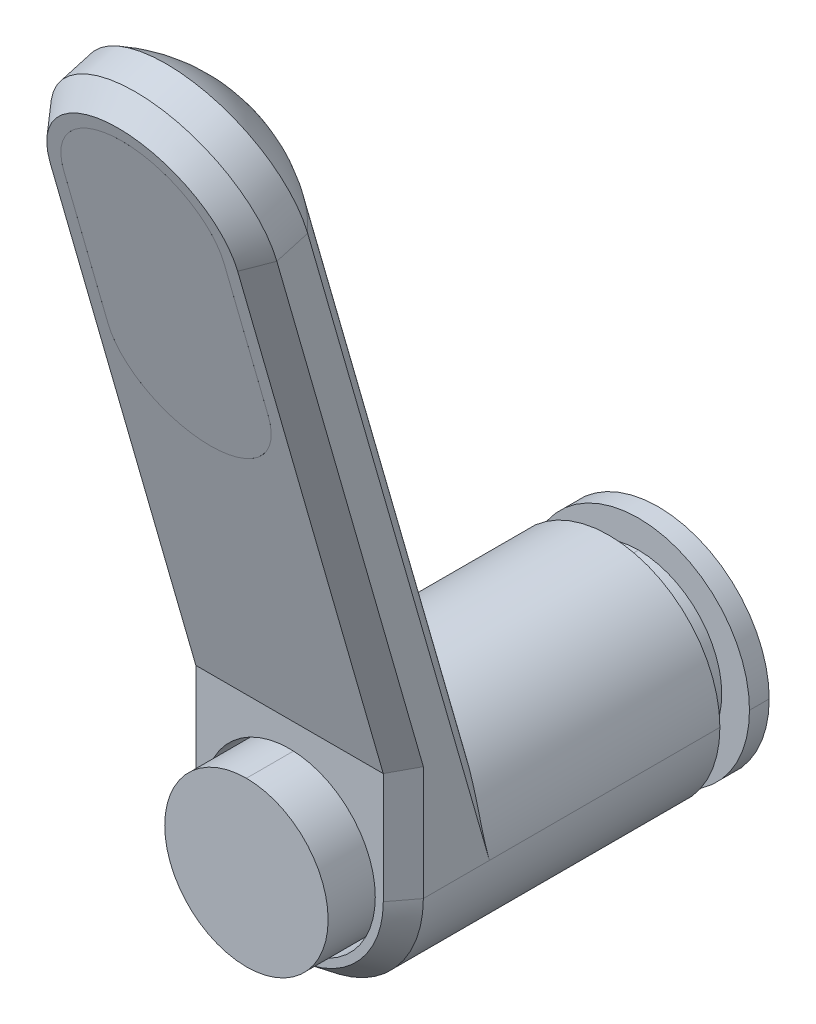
ISO-10303-21;
HEADER;
FILE_DESCRIPTION(('STEP AP214'),'2;1');
FILE_NAME('part.step','',(''),(''),'','','');
FILE_SCHEMA(('AUTOMOTIVE_DESIGN { 1 0 10303 214 1 1 1 1 }'));
ENDSEC;
DATA;
#1=APPLICATION_CONTEXT('core data for automotive mechanical design processes');
#2=APPLICATION_PROTOCOL_DEFINITION('international standard','automotive_design',2000,#1);
#3=PRODUCT_CONTEXT('',#1,'mechanical');
#4=PRODUCT('Part','Part','',(#3));
#5=PRODUCT_RELATED_PRODUCT_CATEGORY('part','',(#4));
#6=PRODUCT_DEFINITION_FORMATION('','',#4);
#7=PRODUCT_DEFINITION_CONTEXT('part definition',#1,'design');
#8=PRODUCT_DEFINITION('design','',#6,#7);
#9=PRODUCT_DEFINITION_SHAPE('','',#8);
#10=(LENGTH_UNIT() NAMED_UNIT(*) SI_UNIT(.MILLI.,.METRE.));
#11=(NAMED_UNIT(*) PLANE_ANGLE_UNIT() SI_UNIT($,.RADIAN.));
#12=(NAMED_UNIT(*) SI_UNIT($,.STERADIAN.) SOLID_ANGLE_UNIT());
#13=UNCERTAINTY_MEASURE_WITH_UNIT(LENGTH_MEASURE(1.E-05),#10,'distance_accuracy_value','');
#14=(GEOMETRIC_REPRESENTATION_CONTEXT(3) GLOBAL_UNCERTAINTY_ASSIGNED_CONTEXT((#13)) GLOBAL_UNIT_ASSIGNED_CONTEXT((#10,
#11,#12)) REPRESENTATION_CONTEXT('',''));
#15=CARTESIAN_POINT('',(0.,0.,0.));
#16=DIRECTION('',(0.,0.,1.));
#17=DIRECTION('',(1.,0.,0.));
#18=AXIS2_PLACEMENT_3D('',#15,#16,#17);
#19=CARTESIAN_POINT('',(0.,0.,33.4));
#20=DIRECTION('',(0.,0.,1.));
#21=DIRECTION('',(1.,0.,0.));
#22=AXIS2_PLACEMENT_3D('',#19,#20,#21);
#23=PLANE('',#22);
#24=CARTESIAN_POINT('',(0.,0.,33.4));
#25=DIRECTION('',(0.,0.,1.));
#26=DIRECTION('',(0.,-1.,0.));
#27=AXIS2_PLACEMENT_3D('',#24,#25,#26);
#28=CIRCLE('',#27,6.625);
#29=CARTESIAN_POINT('',(0.,-6.625,33.4));
#30=VERTEX_POINT('',#29);
#31=CARTESIAN_POINT('',(0.,6.625,33.4));
#32=VERTEX_POINT('',#31);
#33=EDGE_CURVE('E75',#30,#32,#28,.T.);
#34=ORIENTED_EDGE('',*,*,#33,.T.);
#35=CARTESIAN_POINT('',(0.,0.,33.4));
#36=DIRECTION('',(0.,0.,1.));
#37=DIRECTION('',(0.,-1.,0.));
#38=AXIS2_PLACEMENT_3D('',#35,#36,#37);
#39=CIRCLE('',#38,6.625);
#40=EDGE_CURVE('E60',#32,#30,#39,.T.);
#41=ORIENTED_EDGE('',*,*,#40,.T.);
#42=EDGE_LOOP('',(#34,#41));
#43=FACE_BOUND('',#42,.T.);
#44=ADVANCED_FACE('F52',(#43),#23,.T.);
#45=CARTESIAN_POINT('',(0.,0.,26.4));
#46=DIRECTION('',(0.,0.,-1.));
#47=DIRECTION('',(0.,-1.,0.));
#48=AXIS2_PLACEMENT_3D('',#45,#46,#47);
#49=PLANE('',#48);
#50=CARTESIAN_POINT('',(0.,0.,26.4));
#51=DIRECTION('',(0.,0.,-1.));
#52=DIRECTION('',(0.,-1.,0.));
#53=AXIS2_PLACEMENT_3D('',#50,#51,#52);
#54=CIRCLE('',#53,6.625);
#55=CARTESIAN_POINT('',(0.,-6.625,26.4));
#56=VERTEX_POINT('',#55);
#57=CARTESIAN_POINT('',(0.,6.625,26.4));
#58=VERTEX_POINT('',#57);
#59=EDGE_CURVE('E12',#56,#58,#54,.T.);
#60=ORIENTED_EDGE('',*,*,#59,.T.);
#61=CARTESIAN_POINT('',(0.,0.,26.4));
#62=DIRECTION('',(0.,0.,-1.));
#63=DIRECTION('',(0.,-1.,0.));
#64=AXIS2_PLACEMENT_3D('',#61,#62,#63);
#65=CIRCLE('',#64,6.625);
#66=EDGE_CURVE('E85',#58,#56,#65,.T.);
#67=ORIENTED_EDGE('',*,*,#66,.T.);
#68=EDGE_LOOP('',(#60,#67));
#69=FACE_BOUND('',#68,.T.);
#70=ADVANCED_FACE('F90',(#69),#49,.T.);
#71=CARTESIAN_POINT('',(0.,0.,29.9));
#72=DIRECTION('',(0.,0.,1.));
#73=DIRECTION('',(0.,-1.,0.));
#74=AXIS2_PLACEMENT_3D('',#71,#72,#73);
#75=CYLINDRICAL_SURFACE('',#74,6.625);
#76=DIRECTION('',(0.,0.,1.));
#77=VECTOR('',#76,1.);
#78=CARTESIAN_POINT('',(0.,-6.625,29.9));
#79=LINE('',#78,#77);
#80=EDGE_CURVE('E82',#56,#30,#79,.T.);
#81=ORIENTED_EDGE('',*,*,#80,.T.);
#82=ORIENTED_EDGE('',*,*,#40,.F.);
#83=DIRECTION('',(0.,0.,-1.));
#84=VECTOR('',#83,1.);
#85=CARTESIAN_POINT('',(0.,6.625,29.9));
#86=LINE('',#85,#84);
#87=EDGE_CURVE('E83',#32,#58,#86,.T.);
#88=ORIENTED_EDGE('',*,*,#87,.T.);
#89=ORIENTED_EDGE('',*,*,#59,.F.);
#90=EDGE_LOOP('',(#81,#82,#88,#89));
#91=FACE_BOUND('',#90,.T.);
#92=ADVANCED_FACE('F84',(#91),#75,.T.);
#93=CARTESIAN_POINT('',(0.,0.,29.9));
#94=DIRECTION('',(0.,0.,1.));
#95=DIRECTION('',(0.,-1.,0.));
#96=AXIS2_PLACEMENT_3D('',#93,#94,#95);
#97=CYLINDRICAL_SURFACE('',#96,6.625);
#98=ORIENTED_EDGE('',*,*,#80,.F.);
#99=ORIENTED_EDGE('',*,*,#66,.F.);
#100=ORIENTED_EDGE('',*,*,#87,.F.);
#101=ORIENTED_EDGE('',*,*,#33,.F.);
#102=EDGE_LOOP('',(#98,#99,#100,#101));
#103=FACE_BOUND('',#102,.T.);
#104=ADVANCED_FACE('F80',(#103),#97,.T.);
#105=CLOSED_SHELL('',(#44,#70,#92,#104));
#106=MANIFOLD_SOLID_BREP('B2',#105);
#107=CARTESIAN_POINT('',(0.,0.,1.6));
#108=DIRECTION('',(0.,0.,1.));
#109=DIRECTION('',(1.,0.,0.));
#110=AXIS2_PLACEMENT_3D('',#107,#108,#109);
#111=PLANE('',#110);
#112=CARTESIAN_POINT('',(0.,0.,1.6));
#113=DIRECTION('',(0.,0.,-1.));
#114=DIRECTION('',(0.,-1.,0.));
#115=AXIS2_PLACEMENT_3D('',#112,#113,#114);
#116=CIRCLE('',#115,6.75);
#117=CARTESIAN_POINT('',(0.,6.75,1.6));
#118=VERTEX_POINT('',#117);
#119=CARTESIAN_POINT('',(0.,-6.75,1.6));
#120=VERTEX_POINT('',#119);
#121=EDGE_CURVE('E583',#118,#120,#116,.T.);
#122=ORIENTED_EDGE('',*,*,#121,.T.);
#123=CARTESIAN_POINT('',(0.,0.,1.6));
#124=DIRECTION('',(0.,0.,-1.));
#125=DIRECTION('',(0.,-1.,0.));
#126=AXIS2_PLACEMENT_3D('',#123,#124,#125);
#127=CIRCLE('',#126,6.75);
#128=EDGE_CURVE('E659',#120,#118,#127,.T.);
#129=ORIENTED_EDGE('',*,*,#128,.T.);
#130=EDGE_LOOP('',(#122,#129));
#131=FACE_BOUND('',#130,.T.);
#132=CARTESIAN_POINT('',(0.,0.,1.6));
#133=DIRECTION('',(0.,0.,1.));
#134=DIRECTION('',(1.,0.,0.));
#135=AXIS2_PLACEMENT_3D('',#132,#133,#134);
#136=CIRCLE('',#135,9.);
#137=CARTESIAN_POINT('',(9.,0.,1.6));
#138=VERTEX_POINT('',#137);
#139=CARTESIAN_POINT('',(-9.,0.,1.6));
#140=VERTEX_POINT('',#139);
#141=EDGE_CURVE('E456',#138,#140,#136,.T.);
#142=ORIENTED_EDGE('',*,*,#141,.T.);
#143=CARTESIAN_POINT('',(0.,0.,1.6));
#144=DIRECTION('',(0.,0.,1.));
#145=DIRECTION('',(1.,0.,0.));
#146=AXIS2_PLACEMENT_3D('',#143,#144,#145);
#147=CIRCLE('',#146,9.);
#148=EDGE_CURVE('E133',#140,#138,#147,.T.);
#149=ORIENTED_EDGE('',*,*,#148,.T.);
#150=EDGE_LOOP('',(#142,#149));
#151=FACE_BOUND('',#150,.T.);
#152=ADVANCED_FACE('F123',(#131,#151),#111,.T.);
#153=CARTESIAN_POINT('',(0.,0.,0.));
#154=DIRECTION('',(0.,0.,-1.));
#155=DIRECTION('',(0.,-1.,0.));
#156=AXIS2_PLACEMENT_3D('',#153,#154,#155);
#157=PLANE('',#156);
#158=CARTESIAN_POINT('',(0.,0.,0.));
#159=DIRECTION('',(0.,0.,1.));
#160=DIRECTION('',(0.,-1.,0.));
#161=AXIS2_PLACEMENT_3D('',#158,#159,#160);
#162=CIRCLE('',#161,3.001);
#163=CARTESIAN_POINT('',(0.,-3.001,0.));
#164=VERTEX_POINT('',#163);
#165=CARTESIAN_POINT('',(0.,3.001,0.));
#166=VERTEX_POINT('',#165);
#167=EDGE_CURVE('E437',#164,#166,#162,.T.);
#168=ORIENTED_EDGE('',*,*,#167,.T.);
#169=CARTESIAN_POINT('',(0.,0.,0.));
#170=DIRECTION('',(0.,0.,1.));
#171=DIRECTION('',(0.,-1.,0.));
#172=AXIS2_PLACEMENT_3D('',#169,#170,#171);
#173=CIRCLE('',#172,3.001);
#174=EDGE_CURVE('E528',#166,#164,#173,.T.);
#175=ORIENTED_EDGE('',*,*,#174,.T.);
#176=EDGE_LOOP('',(#168,#175));
#177=FACE_BOUND('',#176,.T.);
#178=CARTESIAN_POINT('',(0.,0.,0.));
#179=DIRECTION('',(0.,0.,-1.));
#180=DIRECTION('',(1.,0.,0.));
#181=AXIS2_PLACEMENT_3D('',#178,#179,#180);
#182=CIRCLE('',#181,9.);
#183=CARTESIAN_POINT('',(9.,0.,0.));
#184=VERTEX_POINT('',#183);
#185=CARTESIAN_POINT('',(-9.,0.,0.));
#186=VERTEX_POINT('',#185);
#187=EDGE_CURVE('E50',#184,#186,#182,.T.);
#188=ORIENTED_EDGE('',*,*,#187,.T.);
#189=CARTESIAN_POINT('',(0.,0.,0.));
#190=DIRECTION('',(0.,0.,-1.));
#191=DIRECTION('',(1.,0.,0.));
#192=AXIS2_PLACEMENT_3D('',#189,#190,#191);
#193=CIRCLE('',#192,9.);
#194=EDGE_CURVE('E630',#186,#184,#193,.T.);
#195=ORIENTED_EDGE('',*,*,#194,.T.);
#196=EDGE_LOOP('',(#188,#195));
#197=FACE_BOUND('',#196,.T.);
#198=ADVANCED_FACE('F956',(#177,#197),#157,.T.);
#199=CARTESIAN_POINT('',(0.,0.,0.8));
#200=DIRECTION('',(0.,0.,1.));
#201=DIRECTION('',(1.,0.,0.));
#202=AXIS2_PLACEMENT_3D('',#199,#200,#201);
#203=CYLINDRICAL_SURFACE('',#202,9.);
#204=DIRECTION('',(0.,0.,1.));
#205=VECTOR('',#204,1.);
#206=CARTESIAN_POINT('',(9.,0.,0.8));
#207=LINE('',#206,#205);
#208=EDGE_CURVE('E633',#184,#138,#207,.T.);
#209=ORIENTED_EDGE('',*,*,#208,.T.);
#210=ORIENTED_EDGE('',*,*,#148,.F.);
#211=DIRECTION('',(0.,0.,-1.));
#212=VECTOR('',#211,1.);
#213=CARTESIAN_POINT('',(-9.,0.,0.8));
#214=LINE('',#213,#212);
#215=EDGE_CURVE('E460',#140,#186,#214,.T.);
#216=ORIENTED_EDGE('',*,*,#215,.T.);
#217=ORIENTED_EDGE('',*,*,#187,.F.);
#218=EDGE_LOOP('',(#209,#210,#216,#217));
#219=FACE_BOUND('',#218,.T.);
#220=ADVANCED_FACE('F962',(#219),#203,.T.);
#221=CARTESIAN_POINT('',(0.,43.9418626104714,39.9194182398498));
#222=DIRECTION('',(0.,-0.275637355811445,0.961261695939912));
#223=DIRECTION('',(-1.,0.,0.));
#224=AXIS2_PLACEMENT_3D('',#221,#222,#223);
#225=PLANE('',#224);
#226=CARTESIAN_POINT('',(0.,50.1900636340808,41.7110610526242));
#227=DIRECTION('',(0.,0.275637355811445,-0.961261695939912));
#228=DIRECTION('',(1.,0.,0.));
#229=AXIS2_PLACEMENT_3D('',#226,#227,#228);
#230=CIRCLE('',#229,6.499);
#231=CARTESIAN_POINT('',(-6.499,50.1900636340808,41.7110610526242));
#232=VERTEX_POINT('',#231);
#233=CARTESIAN_POINT('',(6.499,50.1900636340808,41.7110610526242));
#234=VERTEX_POINT('',#233);
#235=EDGE_CURVE('E426',#232,#234,#230,.T.);
#236=ORIENTED_EDGE('',*,*,#235,.F.);
#237=DIRECTION('',(0.,0.961261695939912,0.275637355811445));
#238=VECTOR('',#237,1.);
#239=CARTESIAN_POINT('',(-6.499,37.693661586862,38.1277754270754));
#240=LINE('',#239,#238);
#241=CARTESIAN_POINT('',(-6.499,37.693661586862,38.1277754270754));
#242=VERTEX_POINT('',#241);
#243=EDGE_CURVE('E142',#242,#232,#240,.T.);
#244=ORIENTED_EDGE('',*,*,#243,.F.);
#245=CARTESIAN_POINT('',(0.,37.693661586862,38.1277754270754));
#246=DIRECTION('',(0.,0.275637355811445,-0.961261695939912));
#247=DIRECTION('',(-1.,0.,0.));
#248=AXIS2_PLACEMENT_3D('',#245,#246,#247);
#249=CIRCLE('',#248,6.499);
#250=CARTESIAN_POINT('',(6.499,37.693661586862,38.1277754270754));
#251=VERTEX_POINT('',#250);
#252=EDGE_CURVE('E390',#251,#242,#249,.T.);
#253=ORIENTED_EDGE('',*,*,#252,.F.);
#254=DIRECTION('',(0.,-0.961261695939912,-0.275637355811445));
#255=VECTOR('',#254,1.);
#256=CARTESIAN_POINT('',(6.499,50.1900636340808,41.7110610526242));
#257=LINE('',#256,#255);
#258=EDGE_CURVE('E377',#234,#251,#257,.T.);
#259=ORIENTED_EDGE('',*,*,#258,.F.);
#260=EDGE_LOOP('',(#236,#244,#253,#259));
#261=FACE_BOUND('',#260,.T.);
#262=ADVANCED_FACE('F125',(#261),#225,.T.);
#263=CARTESIAN_POINT('',(-6.499,47.7550565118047,38.4120854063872));
#264=DIRECTION('',(-1.,0.,0.));
#265=DIRECTION('',(0.,0.,1.));
#266=AXIS2_PLACEMENT_3D('',#263,#264,#265);
#267=PLANE('',#266);
#268=ORIENTED_EDGE('',*,*,#243,.T.);
#269=DIRECTION('',(0.,-0.275637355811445,0.961261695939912));
#270=VECTOR('',#269,1.);
#271=CARTESIAN_POINT('',(-6.499,50.8791570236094,39.3079068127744));
#272=LINE('',#271,#270);
#273=CARTESIAN_POINT('',(-6.499,50.8791570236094,39.3079068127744));
#274=VERTEX_POINT('',#273);
#275=EDGE_CURVE('E430',#274,#232,#272,.T.);
#276=ORIENTED_EDGE('',*,*,#275,.F.);
#277=DIRECTION('',(0.,0.961261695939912,0.275637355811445));
#278=VECTOR('',#277,1.);
#279=CARTESIAN_POINT('',(-6.499,44.630956,37.516264));
#280=LINE('',#279,#278);
#281=CARTESIAN_POINT('',(-6.499,50.7695604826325,39.2764805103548));
#282=VERTEX_POINT('',#281);
#283=EDGE_CURVE('E386',#282,#274,#280,.T.);
#284=ORIENTED_EDGE('',*,*,#283,.F.);
#285=DIRECTION('',(0.,0.961261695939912,0.275637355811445));
#286=VECTOR('',#285,1.);
#287=CARTESIAN_POINT('',(-6.499,44.630956,37.516264));
#288=LINE('',#287,#286);
#289=CARTESIAN_POINT('',(-6.499,38.3827549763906,35.7246211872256));
#290=VERTEX_POINT('',#289);
#291=EDGE_CURVE('E552',#290,#282,#288,.T.);
#292=ORIENTED_EDGE('',*,*,#291,.F.);
#293=DIRECTION('',(0.,-0.275637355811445,0.961261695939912));
#294=VECTOR('',#293,1.);
#295=CARTESIAN_POINT('',(-6.499,38.3827549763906,35.7246211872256));
#296=LINE('',#295,#294);
#297=EDGE_CURVE('E392',#290,#242,#296,.T.);
#298=ORIENTED_EDGE('',*,*,#297,.T.);
#299=EDGE_LOOP('',(#268,#276,#284,#292,#298));
#300=FACE_BOUND('',#299,.T.);
#301=ADVANCED_FACE('F926',(#300),#267,.T.);
#302=CARTESIAN_POINT('',(0.,38.3827549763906,35.7246211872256));
#303=DIRECTION('',(0.,-0.275637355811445,0.961261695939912));
#304=DIRECTION('',(-1.,0.,0.));
#305=AXIS2_PLACEMENT_3D('',#302,#303,#304);
#306=CYLINDRICAL_SURFACE('',#305,6.499);
#307=ORIENTED_EDGE('',*,*,#252,.T.);
#308=ORIENTED_EDGE('',*,*,#297,.F.);
#309=CARTESIAN_POINT('',(0.,38.3827549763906,35.7246211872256));
#310=DIRECTION('',(0.,-0.275637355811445,0.961261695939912));
#311=DIRECTION('',(-1.,0.,0.));
#312=AXIS2_PLACEMENT_3D('',#309,#310,#311);
#313=CIRCLE('',#312,6.499);
#314=CARTESIAN_POINT('',(6.499,38.3827549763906,35.7246211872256));
#315=VERTEX_POINT('',#314);
#316=EDGE_CURVE('E551',#290,#315,#313,.T.);
#317=ORIENTED_EDGE('',*,*,#316,.T.);
#318=DIRECTION('',(0.,-0.275637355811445,0.961261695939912));
#319=VECTOR('',#318,1.);
#320=CARTESIAN_POINT('',(6.499,38.3827549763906,35.7246211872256));
#321=LINE('',#320,#319);
#322=EDGE_CURVE('E387',#315,#251,#321,.T.);
#323=ORIENTED_EDGE('',*,*,#322,.T.);
#324=EDGE_LOOP('',(#307,#308,#317,#323));
#325=FACE_BOUND('',#324,.T.);
#326=ADVANCED_FACE('F911',(#325),#306,.T.);
#327=CARTESIAN_POINT('',(6.499,44.630956,37.516264));
#328=DIRECTION('',(1.,0.,0.));
#329=DIRECTION('',(0.,1.,0.));
#330=AXIS2_PLACEMENT_3D('',#327,#328,#329);
#331=PLANE('',#330);
#332=ORIENTED_EDGE('',*,*,#258,.T.);
#333=ORIENTED_EDGE('',*,*,#322,.F.);
#334=DIRECTION('',(0.,-0.961261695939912,-0.275637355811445));
#335=VECTOR('',#334,1.);
#336=CARTESIAN_POINT('',(6.499,50.8791570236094,39.3079068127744));
#337=LINE('',#336,#335);
#338=CARTESIAN_POINT('',(6.499,50.7695604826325,39.2764805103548));
#339=VERTEX_POINT('',#338);
#340=EDGE_CURVE('E548',#339,#315,#337,.T.);
#341=ORIENTED_EDGE('',*,*,#340,.F.);
#342=DIRECTION('',(0.,-0.961261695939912,-0.275637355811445));
#343=VECTOR('',#342,1.);
#344=CARTESIAN_POINT('',(6.499,50.8791570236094,39.3079068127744));
#345=LINE('',#344,#343);
#346=CARTESIAN_POINT('',(6.499,50.8791570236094,39.3079068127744));
#347=VERTEX_POINT('',#346);
#348=EDGE_CURVE('E374',#347,#339,#345,.T.);
#349=ORIENTED_EDGE('',*,*,#348,.F.);
#350=DIRECTION('',(0.,-0.275637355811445,0.961261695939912));
#351=VECTOR('',#350,1.);
#352=CARTESIAN_POINT('',(6.499,50.8791570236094,39.3079068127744));
#353=LINE('',#352,#351);
#354=EDGE_CURVE('E429',#347,#234,#353,.T.);
#355=ORIENTED_EDGE('',*,*,#354,.T.);
#356=EDGE_LOOP('',(#332,#333,#341,#349,#355));
#357=FACE_BOUND('',#356,.T.);
#358=ADVANCED_FACE('F917',(#357),#331,.T.);
#359=CARTESIAN_POINT('',(0.,50.8791570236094,39.3079068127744));
#360=DIRECTION('',(0.,-0.275637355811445,0.961261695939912));
#361=DIRECTION('',(1.,0.,0.));
#362=AXIS2_PLACEMENT_3D('',#359,#360,#361);
#363=CYLINDRICAL_SURFACE('',#362,6.499);
#364=DIRECTION('',(0.,-0.275637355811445,0.961261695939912));
#365=VECTOR('',#364,1.);
#366=CARTESIAN_POINT('',(6.499,50.8791570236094,39.3079068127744));
#367=LINE('',#366,#365);
#368=CARTESIAN_POINT('',(6.499,51.4304317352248,37.3853834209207));
#369=VERTEX_POINT('',#368);
#370=EDGE_CURVE('E459',#369,#347,#367,.T.);
#371=ORIENTED_EDGE('',*,*,#370,.T.);
#372=CARTESIAN_POINT('',(0.,50.8791570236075,39.3079068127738));
#373=DIRECTION('',(0.,-0.275637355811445,0.961261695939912));
#374=DIRECTION('',(-1.,0.,0.));
#375=AXIS2_PLACEMENT_3D('',#372,#373,#374);
#376=CIRCLE('',#375,6.499);
#377=EDGE_CURVE('E378',#274,#347,#376,.T.);
#378=ORIENTED_EDGE('',*,*,#377,.F.);
#379=DIRECTION('',(0.,0.275637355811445,-0.961261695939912));
#380=VECTOR('',#379,1.);
#381=CARTESIAN_POINT('',(-6.499,50.8791570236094,39.3079068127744));
#382=LINE('',#381,#380);
#383=CARTESIAN_POINT('',(-6.499,51.4304317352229,37.3853834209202));
#384=VERTEX_POINT('',#383);
#385=EDGE_CURVE('E643',#274,#384,#382,.T.);
#386=ORIENTED_EDGE('',*,*,#385,.T.);
#387=CARTESIAN_POINT('',(0.,51.4304317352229,37.3853834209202));
#388=DIRECTION('',(0.,0.275637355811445,-0.961261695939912));
#389=DIRECTION('',(-1.,0.,0.));
#390=AXIS2_PLACEMENT_3D('',#387,#388,#389);
#391=CIRCLE('',#390,6.499);
#392=EDGE_CURVE('E489',#369,#384,#391,.T.);
#393=ORIENTED_EDGE('',*,*,#392,.F.);
#394=EDGE_LOOP('',(#371,#378,#386,#393));
#395=FACE_BOUND('',#394,.T.);
#396=ADVANCED_FACE('F929',(#395),#363,.T.);
#397=CARTESIAN_POINT('',(0.,44.630956,37.516264));
#398=DIRECTION('',(0.,-0.275637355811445,0.961261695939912));
#399=DIRECTION('',(-1.,0.,0.));
#400=AXIS2_PLACEMENT_3D('',#397,#398,#399);
#401=PLANE('',#400);
#402=CARTESIAN_POINT('',(0.,50.87915696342,39.3079067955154));
#403=DIRECTION('',(0.,0.275637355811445,-0.961261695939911));
#404=DIRECTION('',(1.,0.,0.));
#405=AXIS2_PLACEMENT_3D('',#402,#403,#404);
#406=CIRCLE('',#405,6.5);
#407=EDGE_CURVE('E626',#339,#282,#406,.T.);
#408=ORIENTED_EDGE('',*,*,#407,.T.);
#409=ORIENTED_EDGE('',*,*,#283,.T.);
#410=ORIENTED_EDGE('',*,*,#377,.T.);
#411=ORIENTED_EDGE('',*,*,#348,.T.);
#412=EDGE_LOOP('',(#408,#409,#410,#411));
#413=FACE_BOUND('',#412,.T.);
#414=ADVANCED_FACE('F883',(#413),#401,.F.);
#415=CARTESIAN_POINT('',(-4.5,0.,4.));
#416=DIRECTION('',(0.,0.,-1.));
#417=DIRECTION('',(0.,-1.,0.));
#418=AXIS2_PLACEMENT_3D('',#415,#416,#417);
#419=PLANE('',#418);
#420=CARTESIAN_POINT('',(0.,0.,4.));
#421=DIRECTION('',(0.,0.,1.));
#422=DIRECTION('',(-1.,0.,0.));
#423=AXIS2_PLACEMENT_3D('',#420,#421,#422);
#424=CIRCLE('',#423,6.751);
#425=CARTESIAN_POINT('',(-6.751,0.,4.));
#426=VERTEX_POINT('',#425);
#427=CARTESIAN_POINT('',(6.751,0.,4.));
#428=VERTEX_POINT('',#427);
#429=EDGE_CURVE('E545',#426,#428,#424,.T.);
#430=ORIENTED_EDGE('',*,*,#429,.T.);
#431=CARTESIAN_POINT('',(0.,0.,4.));
#432=DIRECTION('',(0.,0.,1.));
#433=DIRECTION('',(-1.,0.,0.));
#434=AXIS2_PLACEMENT_3D('',#431,#432,#433);
#435=CIRCLE('',#434,6.751);
#436=EDGE_CURVE('E487',#428,#426,#435,.T.);
#437=ORIENTED_EDGE('',*,*,#436,.T.);
#438=EDGE_LOOP('',(#430,#437));
#439=FACE_BOUND('',#438,.T.);
#440=CARTESIAN_POINT('',(0.,0.,4.));
#441=DIRECTION('',(0.,0.,1.));
#442=DIRECTION('',(-1.,0.,0.));
#443=AXIS2_PLACEMENT_3D('',#440,#441,#442);
#444=CIRCLE('',#443,9.);
#445=CARTESIAN_POINT('',(-9.,0.,4.));
#446=VERTEX_POINT('',#445);
#447=CARTESIAN_POINT('',(9.,0.,4.));
#448=VERTEX_POINT('',#447);
#449=EDGE_CURVE('E613',#446,#448,#444,.T.);
#450=ORIENTED_EDGE('',*,*,#449,.F.);
#451=CARTESIAN_POINT('',(0.,0.,4.));
#452=DIRECTION('',(0.,0.,1.));
#453=DIRECTION('',(-1.,0.,0.));
#454=AXIS2_PLACEMENT_3D('',#451,#452,#453);
#455=CIRCLE('',#454,9.);
#456=EDGE_CURVE('E561',#448,#446,#455,.T.);
#457=ORIENTED_EDGE('',*,*,#456,.F.);
#458=EDGE_LOOP('',(#450,#457));
#459=FACE_BOUND('',#458,.T.);
#460=ADVANCED_FACE('F880',(#439,#459),#419,.T.);
#461=CARTESIAN_POINT('',(-3.8,0.,29.9));
#462=DIRECTION('',(0.,0.,1.));
#463=DIRECTION('',(1.,0.,0.));
#464=AXIS2_PLACEMENT_3D('',#461,#462,#463);
#465=PLANE('',#464);
#466=CARTESIAN_POINT('',(0.,0.,29.9));
#467=DIRECTION('',(0.,0.,-1.));
#468=DIRECTION('',(-1.,0.,0.));
#469=AXIS2_PLACEMENT_3D('',#466,#467,#468);
#470=CIRCLE('',#469,6.951);
#471=CARTESIAN_POINT('',(-6.951,0.,29.9));
#472=VERTEX_POINT('',#471);
#473=CARTESIAN_POINT('',(6.951,0.,29.9));
#474=VERTEX_POINT('',#473);
#475=EDGE_CURVE('E357',#472,#474,#470,.T.);
#476=ORIENTED_EDGE('',*,*,#475,.T.);
#477=CARTESIAN_POINT('',(0.,0.,29.9));
#478=DIRECTION('',(0.,0.,-1.));
#479=DIRECTION('',(-1.,0.,0.));
#480=AXIS2_PLACEMENT_3D('',#477,#478,#479);
#481=CIRCLE('',#480,6.951);
#482=EDGE_CURVE('E369',#474,#472,#481,.T.);
#483=ORIENTED_EDGE('',*,*,#482,.T.);
#484=EDGE_LOOP('',(#476,#483));
#485=FACE_BOUND('',#484,.T.);
#486=CARTESIAN_POINT('',(0.,0.,29.9));
#487=DIRECTION('',(0.,0.,1.));
#488=DIRECTION('',(-1.,0.,0.));
#489=AXIS2_PLACEMENT_3D('',#486,#487,#488);
#490=CIRCLE('',#489,7.6);
#491=CARTESIAN_POINT('',(-7.6,0.,29.9));
#492=VERTEX_POINT('',#491);
#493=CARTESIAN_POINT('',(7.6,0.,29.9));
#494=VERTEX_POINT('',#493);
#495=EDGE_CURVE('E563',#492,#494,#490,.T.);
#496=ORIENTED_EDGE('',*,*,#495,.T.);
#497=DIRECTION('',(0.,1.,0.));
#498=VECTOR('',#497,1.);
#499=CARTESIAN_POINT('',(7.6,0.,29.9));
#500=LINE('',#499,#498);
#501=CARTESIAN_POINT('',(7.6,9.,29.9));
#502=VERTEX_POINT('',#501);
#503=EDGE_CURVE('E401',#494,#502,#500,.T.);
#504=ORIENTED_EDGE('',*,*,#503,.T.);
#505=DIRECTION('',(1.,0.,0.));
#506=VECTOR('',#505,1.);
#507=CARTESIAN_POINT('',(0.,9.,29.9));
#508=LINE('',#507,#506);
#509=CARTESIAN_POINT('',(-7.6,9.,29.9));
#510=VERTEX_POINT('',#509);
#511=EDGE_CURVE('E462',#510,#502,#508,.T.);
#512=ORIENTED_EDGE('',*,*,#511,.F.);
#513=DIRECTION('',(0.,1.,0.));
#514=VECTOR('',#513,1.);
#515=CARTESIAN_POINT('',(-7.6,0.,29.9));
#516=LINE('',#515,#514);
#517=EDGE_CURVE('E356',#492,#510,#516,.T.);
#518=ORIENTED_EDGE('',*,*,#517,.F.);
#519=EDGE_LOOP('',(#496,#504,#512,#518));
#520=FACE_BOUND('',#519,.T.);
#521=ADVANCED_FACE('F693',(#485,#520),#465,.T.);
#522=CARTESIAN_POINT('',(0.,0.,28.975));
#523=DIRECTION('',(0.,0.,-1.));
#524=DIRECTION('',(-1.,0.,0.));
#525=AXIS2_PLACEMENT_3D('',#522,#523,#524);
#526=CONICAL_SURFACE('',#525,8.3,0.647811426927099);
#527=DIRECTION('',(0.603442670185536,0.,0.797406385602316));
#528=VECTOR('',#527,1.);
#529=CARTESIAN_POINT('',(-8.3,0.,28.975));
#530=LINE('',#529,#528);
#531=CARTESIAN_POINT('',(-9.,0.,28.05));
#532=VERTEX_POINT('',#531);
#533=EDGE_CURVE('E351',#532,#492,#530,.T.);
#534=ORIENTED_EDGE('',*,*,#533,.F.);
#535=CARTESIAN_POINT('',(0.,0.,28.05));
#536=DIRECTION('',(0.,0.,1.));
#537=DIRECTION('',(-1.,0.,0.));
#538=AXIS2_PLACEMENT_3D('',#535,#536,#537);
#539=CIRCLE('',#538,9.);
#540=CARTESIAN_POINT('',(9.,0.,28.05));
#541=VERTEX_POINT('',#540);
#542=EDGE_CURVE('E746',#532,#541,#539,.T.);
#543=ORIENTED_EDGE('',*,*,#542,.T.);
#544=DIRECTION('',(-0.603442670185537,0.,0.797406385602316));
#545=VECTOR('',#544,1.);
#546=CARTESIAN_POINT('',(8.3,0.,28.975));
#547=LINE('',#546,#545);
#548=EDGE_CURVE('E629',#541,#494,#547,.T.);
#549=ORIENTED_EDGE('',*,*,#548,.T.);
#550=ORIENTED_EDGE('',*,*,#495,.F.);
#551=EDGE_LOOP('',(#534,#543,#549,#550));
#552=FACE_BOUND('',#551,.T.);
#553=ADVANCED_FACE('F692',(#552),#526,.T.);
#554=CARTESIAN_POINT('',(0.,0.,16.025));
#555=DIRECTION('',(0.,0.,1.));
#556=DIRECTION('',(-1.,0.,0.));
#557=AXIS2_PLACEMENT_3D('',#554,#555,#556);
#558=CYLINDRICAL_SURFACE('',#557,9.);
#559=DIRECTION('',(0.,0.,1.));
#560=VECTOR('',#559,1.);
#561=CARTESIAN_POINT('',(-9.,0.,16.025));
#562=LINE('',#561,#560);
#563=CARTESIAN_POINT('',(-9.,0.,22.6899590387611));
#564=VERTEX_POINT('',#563);
#565=EDGE_CURVE('E515',#446,#564,#562,.T.);
#566=ORIENTED_EDGE('',*,*,#565,.T.);
#567=CARTESIAN_POINT('',(-9.,0.,22.6899590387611));
#568=CARTESIAN_POINT('',(-9.00000424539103,0.102857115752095,22.7194576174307));
#569=CARTESIAN_POINT('',(-8.99823685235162,0.206284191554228,22.7469829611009));
#570=CARTESIAN_POINT('',(-8.99108644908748,0.413592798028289,22.7979071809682));
#571=CARTESIAN_POINT('',(-8.98571769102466,0.51747093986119,22.8213218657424));
#572=CARTESIAN_POINT('',(-8.97131117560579,0.725555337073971,22.8640258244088));
#573=CARTESIAN_POINT('',(-8.96228241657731,0.829760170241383,22.8833250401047));
#574=CARTESIAN_POINT('',(-8.94051403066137,1.03836171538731,22.9178052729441));
#575=CARTESIAN_POINT('',(-8.92777785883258,1.14275815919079,22.9329900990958));
#576=CARTESIAN_POINT('',(-8.89855407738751,1.35161344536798,22.959247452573));
#577=CARTESIAN_POINT('',(-8.88206423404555,1.45607228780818,22.9703175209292));
#578=CARTESIAN_POINT('',(-8.85451003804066,1.61259599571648,22.9838354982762));
#579=CARTESIAN_POINT('',(-8.84484718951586,1.66478176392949,22.987828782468));
#580=CARTESIAN_POINT('',(-8.82495407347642,1.76714583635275,22.9946564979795));
#581=CARTESIAN_POINT('',(-8.81475718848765,1.81732817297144,22.9975277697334));
#582=CARTESIAN_POINT('',(-8.78250948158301,1.96935993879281,23.0048275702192));
#583=CARTESIAN_POINT('',(-8.75910069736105,2.07099762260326,23.0077979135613));
#584=CARTESIAN_POINT('',(-8.70816937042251,2.27578076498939,23.0101685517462));
#585=CARTESIAN_POINT('',(-8.6805638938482,2.37890639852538,23.0094843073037));
#586=CARTESIAN_POINT('',(-8.62102384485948,2.58648061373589,23.0045456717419));
#587=CARTESIAN_POINT('',(-8.58900167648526,2.69090202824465,23.0002064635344));
#588=CARTESIAN_POINT('',(-8.52041803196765,2.90085658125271,22.9879611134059));
#589=CARTESIAN_POINT('',(-8.48376495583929,3.00635480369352,22.9799706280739));
#590=CARTESIAN_POINT('',(-8.40571364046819,3.21823517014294,22.9604098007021));
#591=CARTESIAN_POINT('',(-8.36422041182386,3.32457456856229,22.9487557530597));
#592=CARTESIAN_POINT('',(-8.28067615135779,3.52724949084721,22.9232531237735));
#593=CARTESIAN_POINT('',(-8.23890699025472,3.62373126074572,22.909638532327));
#594=CARTESIAN_POINT('',(-8.15028582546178,3.81900878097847,22.8794114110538));
#595=CARTESIAN_POINT('',(-8.10329212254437,3.91772414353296,22.8626946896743));
#596=CARTESIAN_POINT('',(-8.01675322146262,4.0913161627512,22.8309675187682));
#597=CARTESIAN_POINT('',(-7.97787683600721,4.16661046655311,22.8164048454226));
#598=CARTESIAN_POINT('',(-7.87689395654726,4.35561173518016,22.7779385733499));
#599=CARTESIAN_POINT('',(-7.81343798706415,4.46843036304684,22.7531892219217));
#600=CARTESIAN_POINT('',(-7.69161312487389,4.67453128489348,22.7051285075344));
#601=CARTESIAN_POINT('',(-7.63386067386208,4.7682545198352,22.6821375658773));
#602=CARTESIAN_POINT('',(-7.54357484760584,4.90894666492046,22.6460654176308));
#603=CARTESIAN_POINT('',(-7.51221265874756,4.95680645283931,22.6335126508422));
#604=CARTESIAN_POINT('',(-7.45336554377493,5.04477050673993,22.6099397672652));
#605=CARTESIAN_POINT('',(-7.42599927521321,5.08496769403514,22.5989700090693));
#606=CARTESIAN_POINT('',(-7.33953194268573,5.2097918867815,22.5643297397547));
#607=CARTESIAN_POINT('',(-7.27934654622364,5.29355581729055,22.5402472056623));
#608=CARTESIAN_POINT('',(-7.13409650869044,5.48856050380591,22.4824509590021));
#609=CARTESIAN_POINT('',(-7.04787365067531,5.59884016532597,22.4483904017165));
#610=CARTESIAN_POINT('',(-6.91972965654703,5.75510430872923,22.398257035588));
#611=CARTESIAN_POINT('',(-6.87974081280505,5.80284785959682,22.3826774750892));
#612=CARTESIAN_POINT('',(-6.77377311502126,5.9267318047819,22.3416707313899));
#613=CARTESIAN_POINT('',(-6.70701878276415,6.0021692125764,22.3161134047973));
#614=CARTESIAN_POINT('',(-6.557367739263,6.16567620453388,22.2595805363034));
#615=CARTESIAN_POINT('',(-6.47392786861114,6.25322964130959,22.2285505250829));
#616=CARTESIAN_POINT('',(-6.28929897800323,6.43930563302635,22.1611945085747));
#617=CARTESIAN_POINT('',(-6.18748210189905,6.53720169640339,22.1248540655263));
#618=CARTESIAN_POINT('',(-6.01077955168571,6.69927184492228,22.0632601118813));
#619=CARTESIAN_POINT('',(-5.93705018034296,6.7646989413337,22.0379738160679));
#620=CARTESIAN_POINT('',(-5.82740500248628,6.85882356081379,22.0010150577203));
#621=CARTESIAN_POINT('',(-5.79232502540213,6.88847458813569,21.9892846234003));
#622=CARTESIAN_POINT('',(-5.73424662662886,6.93680707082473,21.9700906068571));
#623=CARTESIAN_POINT('',(-5.71138632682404,6.95564114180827,21.9625925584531));
#624=CARTESIAN_POINT('',(-5.60136636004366,7.04537563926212,21.9267254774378));
#625=CARTESIAN_POINT('',(-5.51292584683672,7.11479447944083,21.8985474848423));
#626=CARTESIAN_POINT('',(-5.34123221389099,7.24443075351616,21.8452166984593));
#627=CARTESIAN_POINT('',(-5.25820092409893,7.3049222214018,21.8200146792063));
#628=CARTESIAN_POINT('',(-5.13506102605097,7.39144263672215,21.7835888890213));
#629=CARTESIAN_POINT('',(-5.09579465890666,7.41856833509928,21.7721115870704));
#630=CARTESIAN_POINT('',(-5.00756274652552,7.47848821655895,21.7466528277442));
#631=CARTESIAN_POINT('',(-4.95847726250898,7.511123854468,21.7327137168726));
#632=CARTESIAN_POINT('',(-4.81268579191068,7.60600244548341,21.6919764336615));
#633=CARTESIAN_POINT('',(-4.71502011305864,7.66693278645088,21.6655362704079));
#634=CARTESIAN_POINT('',(-4.52061091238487,7.78308776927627,21.6146309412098));
#635=CARTESIAN_POINT('',(-4.42395101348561,7.83843652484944,21.590129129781));
#636=CARTESIAN_POINT('',(-4.23189623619,7.94371554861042,21.5431023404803));
#637=CARTESIAN_POINT('',(-4.13657821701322,7.99376840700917,21.5205380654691));
#638=CARTESIAN_POINT('',(-3.94752383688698,8.08874724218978,21.477386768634));
#639=CARTESIAN_POINT('',(-3.85385776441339,8.13379394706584,21.456757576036));
#640=CARTESIAN_POINT('',(-3.6683926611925,8.21905791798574,21.4174892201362));
#641=CARTESIAN_POINT('',(-3.5766577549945,8.25939360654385,21.3988042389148));
#642=CARTESIAN_POINT('',(-3.38027045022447,8.34185040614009,21.3604554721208));
#643=CARTESIAN_POINT('',(-3.27542047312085,8.38357800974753,21.3409552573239));
#644=CARTESIAN_POINT('',(-3.06563386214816,8.46252044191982,21.3038663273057));
#645=CARTESIAN_POINT('',(-2.96072448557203,8.49979588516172,21.2862523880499));
#646=CARTESIAN_POINT('',(-2.75101984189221,8.56994283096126,21.252946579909));
#647=CARTESIAN_POINT('',(-2.64624882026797,8.60287446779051,21.2372287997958));
#648=CARTESIAN_POINT('',(-2.4370157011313,8.66444798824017,21.2077134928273));
#649=CARTESIAN_POINT('',(-2.33257482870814,8.6931493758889,21.193889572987));
#650=CARTESIAN_POINT('',(-2.12418042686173,8.74638432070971,21.1681621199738));
#651=CARTESIAN_POINT('',(-2.02024526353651,8.77097655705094,21.1562316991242));
#652=CARTESIAN_POINT('',(-1.86422777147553,8.80496698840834,21.1397139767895));
#653=CARTESIAN_POINT('',(-1.81251462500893,8.8157576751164,21.1344652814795));
#654=CARTESIAN_POINT('',(-1.70754275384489,8.83669818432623,21.1242740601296));
#655=CARTESIAN_POINT('',(-1.65427827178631,8.8468246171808,21.119342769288));
#656=CARTESIAN_POINT('',(-1.49458302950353,8.87569118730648,21.1052728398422));
#657=CARTESIAN_POINT('',(-1.38783098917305,8.89301018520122,21.0968136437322));
#658=CARTESIAN_POINT('',(-1.17418194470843,8.92372604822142,21.0817841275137));
#659=CARTESIAN_POINT('',(-1.06728833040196,8.93714207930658,21.07520458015));
#660=CARTESIAN_POINT('',(-0.853496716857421,8.96008075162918,21.0639328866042));
#661=CARTESIAN_POINT('',(-0.746601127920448,8.96962150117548,21.0592319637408));
#662=CARTESIAN_POINT('',(-0.532948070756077,8.98484184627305,21.0517174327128));
#663=CARTESIAN_POINT('',(-0.42619210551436,8.99053843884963,21.0488955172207));
#664=CARTESIAN_POINT('',(-0.212957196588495,8.99811043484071,21.0451380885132));
#665=CARTESIAN_POINT('',(-0.10647895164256,9.0000016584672,21.0441947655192));
#666=CARTESIAN_POINT('',(0.,9.,21.0441950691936));
#667=B_SPLINE_CURVE_WITH_KNOTS('',3,(#567,#568,#569,#570,#571,#572,#573,#574,#575,#576,#577,
#578,#579,#580,#581,#582,#583,#584,#585,#586,#587,#588,#589,#590,#591,#592,#593,#594,#595,#596,
#597,#598,#599,#600,#601,#602,#603,#604,#605,#606,#607,#608,#609,#610,#611,#612,#613,#614,#615,
#616,#617,#618,#619,#620,#621,#622,#623,#624,#625,#626,#627,#628,#629,#630,#631,#632,#633,#634,
#635,#636,#637,#638,#639,#640,#641,#642,#643,#644,#645,#646,#647,#648,#649,#650,#651,#652,#653,
#654,#655,#656,#657,#658,#659,#660,#661,#662,#663,#664,#665,#666),.UNSPECIFIED.,.F.,.F.,(4,2,2,
2,2,2,2,2,2,2,2,2,2,2,2,2,2,2,2,2,2,2,2,2,2,2,2,2,2,2,2,2,2,2,2,2,2,2,2,2,2,2,2,2,2,2,2,2,2,4),
(0.,0.320981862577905,0.640700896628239,0.959638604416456,1.27828003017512,1.59711157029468,
1.75676422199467,1.91061486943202,2.22349620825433,2.54364613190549,2.87143690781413,
3.20721538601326,3.55130425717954,3.86925175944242,4.20095008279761,4.45885481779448,
4.85405003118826,5.19135527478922,5.36708745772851,5.51663240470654,5.83432454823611,
6.26635630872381,6.45893903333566,6.77064992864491,7.14514604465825,7.58252085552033,
7.88776521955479,8.02998000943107,8.12164077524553,8.46927758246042,8.78654338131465,
8.93379436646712,9.11549528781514,9.46973296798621,9.81179884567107,10.1417243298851,
10.4595444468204,10.7652984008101,11.1087679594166,11.446839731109,11.7795848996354,
12.1070781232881,12.4293977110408,12.5886503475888,12.7519680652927,13.0773094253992,
13.4010250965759,13.7232102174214,14.0439612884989,14.3633761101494),.UNSPECIFIED.);
#668=CARTESIAN_POINT('',(0.,9.,21.044195));
#669=VERTEX_POINT('',#668);
#670=EDGE_CURVE('E564',#564,#669,#667,.T.);
#671=ORIENTED_EDGE('',*,*,#670,.T.);
#672=CARTESIAN_POINT('',(0.,9.,21.0441950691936));
#673=CARTESIAN_POINT('',(0.117145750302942,9.00000244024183,21.0441945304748));
#674=CARTESIAN_POINT('',(0.234290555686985,8.99771291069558,21.045336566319));
#675=CARTESIAN_POINT('',(0.468903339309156,8.98854624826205,21.0498832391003));
#676=CARTESIAN_POINT('',(0.586370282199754,8.98164780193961,21.0532983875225));
#677=CARTESIAN_POINT('',(0.82144384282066,8.96321385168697,21.0623908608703));
#678=CARTESIAN_POINT('',(0.939048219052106,8.95165532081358,21.0680794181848));
#679=CARTESIAN_POINT('',(1.17420973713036,8.92386260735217,21.0817189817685));
#680=CARTESIAN_POINT('',(1.2917632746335,8.9076037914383,21.0896819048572));
#681=CARTESIAN_POINT('',(1.52663325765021,8.87037813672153,21.1078652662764));
#682=CARTESIAN_POINT('',(1.64394458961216,8.84938515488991,21.1180982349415));
#683=CARTESIAN_POINT('',(1.87524191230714,8.80324443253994,21.140556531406));
#684=CARTESIAN_POINT('',(1.98924896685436,8.77818217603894,21.1527408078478));
#685=CARTESIAN_POINT('',(2.21798955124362,8.72322200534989,21.1793694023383));
#686=CARTESIAN_POINT('',(2.33270016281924,8.69324628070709,21.1938499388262));
#687=CARTESIAN_POINT('',(2.56261847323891,8.62829694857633,21.2250666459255));
#688=CARTESIAN_POINT('',(2.67779901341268,8.59324424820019,21.2418382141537));
#689=CARTESIAN_POINT('',(2.90841100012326,8.51798780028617,21.2776420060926));
#690=CARTESIAN_POINT('',(3.02381090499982,8.47770396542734,21.2967089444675));
#691=CARTESIAN_POINT('',(3.25460415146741,8.39183986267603,21.3370920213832));
#692=CARTESIAN_POINT('',(3.36996153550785,8.34617876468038,21.3584418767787));
#693=CARTESIAN_POINT('',(3.58609794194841,8.25542999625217,21.4006481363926));
#694=CARTESIAN_POINT('',(3.68711101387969,8.21080837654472,21.4213108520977));
#695=CARTESIAN_POINT('',(3.8915323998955,8.11598515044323,21.4649289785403));
#696=CARTESIAN_POINT('',(3.99485447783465,8.06562544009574,21.4879449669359));
#697=CARTESIAN_POINT('',(4.20352514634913,7.95893678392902,21.5362636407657));
#698=CARTESIAN_POINT('',(4.30877837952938,7.90244643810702,21.5616216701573));
#699=CARTESIAN_POINT('',(4.52089872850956,7.78311460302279,21.6146320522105));
#700=CARTESIAN_POINT('',(4.62766075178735,7.72010912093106,21.6423356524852));
#701=CARTESIAN_POINT('',(4.8423447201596,7.58737333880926,21.7000402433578));
#702=CARTESIAN_POINT('',(4.95015140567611,7.51747708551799,21.7300886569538));
#703=CARTESIAN_POINT('',(5.14586686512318,7.3845635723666,21.7865583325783));
#704=CARTESIAN_POINT('',(5.23425349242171,7.32217704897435,21.8128130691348));
#705=CARTESIAN_POINT('',(5.41821616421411,7.18730370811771,21.868858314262));
#706=CARTESIAN_POINT('',(5.51351088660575,7.11446152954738,21.8987195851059));
#707=CARTESIAN_POINT('',(5.657627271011,6.99967140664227,21.945010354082));
#708=CARTESIAN_POINT('',(5.70754883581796,6.95902481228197,21.9612612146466));
#709=CARTESIAN_POINT('',(5.78110185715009,6.89781443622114,21.9855785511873));
#710=CARTESIAN_POINT('',(5.80508539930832,6.87764243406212,21.9935679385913));
#711=CARTESIAN_POINT('',(5.90622232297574,6.7916728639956,22.0274588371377));
#712=CARTESIAN_POINT('',(5.98235361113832,6.72470994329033,22.0534675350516));
#713=CARTESIAN_POINT('',(6.17048303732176,6.5535137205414,22.1188054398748));
#714=CARTESIAN_POINT('',(6.28100421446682,6.44766530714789,22.1581735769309));
#715=CARTESIAN_POINT('',(6.48165130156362,6.24544576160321,22.231363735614));
#716=CARTESIAN_POINT('',(6.57248699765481,6.14978253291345,22.26520139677));
#717=CARTESIAN_POINT('',(6.733448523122,5.97262159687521,22.3261877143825));
#718=CARTESIAN_POINT('',(6.80428559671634,5.89179578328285,22.3534106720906));
#719=CARTESIAN_POINT('',(6.90245325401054,5.77564926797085,22.3915332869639));
#720=CARTESIAN_POINT('',(6.93096919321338,5.74139824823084,22.4026563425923));
#721=CARTESIAN_POINT('',(6.99921573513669,5.6581758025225,22.4293511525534));
#722=CARTESIAN_POINT('',(7.03870063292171,5.60898177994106,22.4448578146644));
#723=CARTESIAN_POINT('',(7.15114583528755,5.46582621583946,22.4892046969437));
#724=CARTESIAN_POINT('',(7.22282806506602,5.37075014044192,22.5177083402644));
#725=CARTESIAN_POINT('',(7.35681511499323,5.18548493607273,22.571234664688));
#726=CARTESIAN_POINT('',(7.41940772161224,5.09553060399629,22.5963515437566));
#727=CARTESIAN_POINT('',(7.55301379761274,4.89581698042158,22.6498393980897));
#728=CARTESIAN_POINT('',(7.62337051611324,4.78553940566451,22.6779231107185));
#729=CARTESIAN_POINT('',(7.75619141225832,4.56695299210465,22.7304523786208));
#730=CARTESIAN_POINT('',(7.81887210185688,4.45880203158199,22.7550076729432));
#731=CARTESIAN_POINT('',(7.93686433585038,4.24503667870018,22.8004893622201));
#732=CARTESIAN_POINT('',(7.99238748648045,4.13956472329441,22.8215356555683));
#733=CARTESIAN_POINT('',(8.09659534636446,3.93166009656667,22.8599860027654));
#734=CARTESIAN_POINT('',(8.14548559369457,3.82935513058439,22.8775226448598));
#735=CARTESIAN_POINT('',(8.23695869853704,3.62822873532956,22.9089290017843));
#736=CARTESIAN_POINT('',(8.27974001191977,3.52952069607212,22.9229463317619));
#737=CARTESIAN_POINT('',(8.36849886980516,3.31419500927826,22.9500862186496));
#738=CARTESIAN_POINT('',(8.41387413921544,3.19726295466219,22.9626973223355));
#739=CARTESIAN_POINT('',(8.4986675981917,2.96438803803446,22.9833984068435));
#740=CARTESIAN_POINT('',(8.538211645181,2.84850087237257,22.9915991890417));
#741=CARTESIAN_POINT('',(8.61162838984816,2.61803340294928,23.0034644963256));
#742=CARTESIAN_POINT('',(8.64562180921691,2.50349745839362,23.007241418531));
#743=CARTESIAN_POINT('',(8.70822942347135,2.27602726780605,23.0102616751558));
#744=CARTESIAN_POINT('',(8.7369582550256,2.16312615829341,23.0096176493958));
#745=CARTESIAN_POINT('',(8.78933610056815,1.9391920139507,23.0037939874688));
#746=CARTESIAN_POINT('',(8.81309265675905,1.8281813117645,22.9987262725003));
#747=CARTESIAN_POINT('',(8.85698930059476,1.60230191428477,22.9836627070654));
#748=CARTESIAN_POINT('',(8.87699948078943,1.48741740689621,22.9735235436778));
#749=CARTESIAN_POINT('',(8.91245277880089,1.25764877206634,22.9482588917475));
#750=CARTESIAN_POINT('',(8.92790181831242,1.142764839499,22.9331399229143));
#751=CARTESIAN_POINT('',(8.95429870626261,0.913178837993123,22.8979242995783));
#752=CARTESIAN_POINT('',(8.96524411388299,0.798476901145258,22.8778249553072));
#753=CARTESIAN_POINT('',(8.98270348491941,0.569432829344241,22.8326563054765));
#754=CARTESIAN_POINT('',(8.98920682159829,0.455092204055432,22.8075752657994));
#755=CARTESIAN_POINT('',(8.99786742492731,0.226934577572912,22.7524589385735));
#756=CARTESIAN_POINT('',(9.00000630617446,0.113121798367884,22.7224032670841));
#757=CARTESIAN_POINT('',(9.,-2.28428306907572E-11,22.6899590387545));
#758=B_SPLINE_CURVE_WITH_KNOTS('',3,(#672,#673,#674,#675,#676,#677,#678,#679,#680,#681,#682,
#683,#684,#685,#686,#687,#688,#689,#690,#691,#692,#693,#694,#695,#696,#697,#698,#699,#700,#701,
#702,#703,#704,#705,#706,#707,#708,#709,#710,#711,#712,#713,#714,#715,#716,#717,#718,#719,#720,
#721,#722,#723,#724,#725,#726,#727,#728,#729,#730,#731,#732,#733,#734,#735,#736,#737,#738,#739,
#740,#741,#742,#743,#744,#745,#746,#747,#748,#749,#750,#751,#752,#753,#754,#755,#756,#757),
.UNSPECIFIED.,.F.,.F.,(4,2,2,2,2,2,2,2,2,2,2,2,2,2,2,2,2,2,2,2,2,2,2,2,2,2,2,2,2,2,2,2,2,2,2,2,
2,2,2,2,2,2,4),(0.,0.35140795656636,0.704452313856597,1.05926298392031,1.4159679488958,
1.7746931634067,2.12667762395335,2.48489854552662,2.8494619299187,3.22046834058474,
3.59801319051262,3.93497102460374,4.28654888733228,4.65279806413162,5.03376388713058,
5.42948660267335,5.76340071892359,6.13411828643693,6.33329228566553,6.43031454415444,
6.74427755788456,7.21811571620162,7.6265644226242,7.95909669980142,8.09689744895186,
8.29175946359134,8.65895789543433,8.99617560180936,9.39740145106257,9.7794478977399,
10.1424434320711,10.4865379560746,10.8119075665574,11.1899049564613,11.5579003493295,
11.9163280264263,12.2656579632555,12.606397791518,12.9573620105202,13.3078685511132,
13.6585648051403,14.0100971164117,14.3631072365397),.UNSPECIFIED.);
#759=CARTESIAN_POINT('',(8.9999999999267,0.,22.6899590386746));
#760=VERTEX_POINT('',#759);
#761=EDGE_CURVE('E712',#669,#760,#758,.T.);
#762=ORIENTED_EDGE('',*,*,#761,.T.);
#763=DIRECTION('',(0.,0.,-1.));
#764=VECTOR('',#763,1.);
#765=CARTESIAN_POINT('',(9.,0.,16.025));
#766=LINE('',#765,#764);
#767=EDGE_CURVE('E616',#760,#448,#766,.T.);
#768=ORIENTED_EDGE('',*,*,#767,.T.);
#769=ORIENTED_EDGE('',*,*,#456,.T.);
#770=EDGE_LOOP('',(#566,#671,#762,#768,#769));
#771=FACE_BOUND('',#770,.T.);
#772=ADVANCED_FACE('F681',(#771),#558,.T.);
#773=CARTESIAN_POINT('',(0.,8.03878254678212,33.2521636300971));
#774=DIRECTION('',(0.,-0.961261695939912,-0.275637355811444));
#775=DIRECTION('',(0.749999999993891,0.182316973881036,-0.635814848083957));
#776=AXIS2_PLACEMENT_3D('',#773,#774,#775);
#777=CYLINDRICAL_SURFACE('',#776,12.);
#778=ORIENTED_EDGE('',*,*,#761,.F.);
#779=ORIENTED_EDGE('',*,*,#670,.F.);
#780=DIRECTION('',(0.,0.961261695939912,0.275637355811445));
#781=VECTOR('',#780,1.);
#782=CARTESIAN_POINT('',(-9.,4.32856501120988,23.9311550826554));
#783=LINE('',#782,#781);
#784=CARTESIAN_POINT('',(-9.,51.4166499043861,37.4334461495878));
#785=VERTEX_POINT('',#784);
#786=EDGE_CURVE('E422',#564,#785,#783,.T.);
#787=ORIENTED_EDGE('',*,*,#786,.T.);
#788=CARTESIAN_POINT('',(0.,49.2288462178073,45.0632243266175));
#789=DIRECTION('',(0.,-0.961261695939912,-0.275637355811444));
#790=DIRECTION('',(0.749999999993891,0.182316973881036,-0.635814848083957));
#791=AXIS2_PLACEMENT_3D('',#788,#789,#790);
#792=CIRCLE('',#791,12.);
#793=CARTESIAN_POINT('',(-4.18886986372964E-11,52.5364944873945,33.528083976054));
#794=VERTEX_POINT('',#793);
#795=EDGE_CURVE('E484',#785,#794,#792,.T.);
#796=ORIENTED_EDGE('',*,*,#795,.T.);
#797=CARTESIAN_POINT('',(0.,49.2288462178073,45.0632243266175));
#798=DIRECTION('',(0.,-0.961261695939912,-0.275637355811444));
#799=DIRECTION('',(0.749999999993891,0.182316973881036,-0.635814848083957));
#800=AXIS2_PLACEMENT_3D('',#797,#798,#799);
#801=CIRCLE('',#800,12.);
#802=CARTESIAN_POINT('',(8.9999999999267,51.4166499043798,37.43344614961));
#803=VERTEX_POINT('',#802);
#804=EDGE_CURVE('E483',#794,#803,#801,.T.);
#805=ORIENTED_EDGE('',*,*,#804,.T.);
#806=DIRECTION('',(0.,-0.961261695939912,-0.275637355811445));
#807=VECTOR('',#806,1.);
#808=CARTESIAN_POINT('',(9.,4.32856501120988,23.9311550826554));
#809=LINE('',#808,#807);
#810=EDGE_CURVE('E572',#803,#760,#809,.T.);
#811=ORIENTED_EDGE('',*,*,#810,.T.);
#812=EDGE_LOOP('',(#778,#779,#787,#796,#805,#811));
#813=FACE_BOUND('',#812,.T.);
#814=ADVANCED_FACE('F691',(#813),#777,.T.);
#815=CARTESIAN_POINT('',(9.,0.,24.5470975));
#816=DIRECTION('',(1.,0.,0.));
#817=DIRECTION('',(0.,1.,0.));
#818=AXIS2_PLACEMENT_3D('',#815,#816,#817);
#819=PLANE('',#818);
#820=DIRECTION('',(0.,0.,1.));
#821=VECTOR('',#820,1.);
#822=CARTESIAN_POINT('',(9.,0.,26.7));
#823=LINE('',#822,#821);
#824=EDGE_CURVE('E759',#760,#541,#823,.T.);
#825=ORIENTED_EDGE('',*,*,#824,.F.);
#826=ORIENTED_EDGE('',*,*,#810,.F.);
#827=DIRECTION('',(0.,-0.275637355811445,0.961261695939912));
#828=VECTOR('',#827,1.);
#829=CARTESIAN_POINT('',(9.,51.4166499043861,37.4334461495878));
#830=LINE('',#829,#828);
#831=CARTESIAN_POINT('',(9.,50.6999927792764,39.9327265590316));
#832=VERTEX_POINT('',#831);
#833=EDGE_CURVE('E569',#803,#832,#830,.T.);
#834=ORIENTED_EDGE('',*,*,#833,.T.);
#835=DIRECTION('',(0.,0.961261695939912,0.275637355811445));
#836=VECTOR('',#835,1.);
#837=CARTESIAN_POINT('',(9.,4.64266935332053,26.7260015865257));
#838=LINE('',#837,#836);
#839=CARTESIAN_POINT('',(9.,9.26000054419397,28.05));
#840=VERTEX_POINT('',#839);
#841=EDGE_CURVE('E476',#840,#832,#838,.T.);
#842=ORIENTED_EDGE('',*,*,#841,.F.);
#843=DIRECTION('',(0.,1.,0.));
#844=VECTOR('',#843,1.);
#845=CARTESIAN_POINT('',(9.,0.,28.05));
#846=LINE('',#845,#844);
#847=EDGE_CURVE('E339',#541,#840,#846,.T.);
#848=ORIENTED_EDGE('',*,*,#847,.F.);
#849=EDGE_LOOP('',(#825,#826,#834,#842,#848));
#850=FACE_BOUND('',#849,.T.);
#851=ADVANCED_FACE('F727',(#850),#819,.T.);
#852=CARTESIAN_POINT('',(0.,50.4450282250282,40.8218936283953));
#853=DIRECTION('',(0.,0.275637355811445,-0.961261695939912));
#854=DIRECTION('',(1.,0.,0.));
#855=AXIS2_PLACEMENT_3D('',#852,#853,#854);
#856=CONICAL_SURFACE('',#855,8.3,0.647811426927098);
#857=DIRECTION('',(-0.603442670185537,0.219794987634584,-0.766516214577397));
#858=VECTOR('',#857,1.);
#859=CARTESIAN_POINT('',(-7.6,50.1900636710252,41.7110606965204));
#860=LINE('',#859,#858);
#861=CARTESIAN_POINT('',(-7.6,50.1900636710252,41.7110606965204));
#862=VERTEX_POINT('',#861);
#863=CARTESIAN_POINT('',(-9.,50.6999927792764,39.9327265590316));
#864=VERTEX_POINT('',#863);
#865=EDGE_CURVE('E334',#862,#864,#860,.T.);
#866=ORIENTED_EDGE('',*,*,#865,.F.);
#867=CARTESIAN_POINT('',(0.,50.1900636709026,41.7110606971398));
#868=DIRECTION('',(0.,-0.275637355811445,0.961261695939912));
#869=DIRECTION('',(1.,0.,0.));
#870=AXIS2_PLACEMENT_3D('',#867,#868,#869);
#871=CIRCLE('',#870,7.6);
#872=CARTESIAN_POINT('',(7.6,50.1900636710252,41.7110606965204));
#873=VERTEX_POINT('',#872);
#874=EDGE_CURVE('E365',#873,#862,#871,.T.);
#875=ORIENTED_EDGE('',*,*,#874,.F.);
#876=DIRECTION('',(-0.603442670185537,-0.219794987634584,0.766516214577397));
#877=VECTOR('',#876,1.);
#878=CARTESIAN_POINT('',(9.,50.6999927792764,39.9327265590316));
#879=LINE('',#878,#877);
#880=EDGE_CURVE('E478',#832,#873,#879,.T.);
#881=ORIENTED_EDGE('',*,*,#880,.F.);
#882=CARTESIAN_POINT('',(0.,50.6999927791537,39.9327265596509));
#883=DIRECTION('',(0.,-0.275637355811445,0.961261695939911));
#884=DIRECTION('',(1.,0.,0.));
#885=AXIS2_PLACEMENT_3D('',#882,#883,#884);
#886=CIRCLE('',#885,9.);
#887=EDGE_CURVE('E573',#832,#864,#886,.T.);
#888=ORIENTED_EDGE('',*,*,#887,.T.);
#889=EDGE_LOOP('',(#866,#875,#881,#888));
#890=FACE_BOUND('',#889,.T.);
#891=ADVANCED_FACE('F1118',(#890),#856,.T.);
#892=CARTESIAN_POINT('',(0.,51.0583213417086,38.683086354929));
#893=DIRECTION('',(0.,-0.275637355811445,0.961261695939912));
#894=DIRECTION('',(1.,0.,0.));
#895=AXIS2_PLACEMENT_3D('',#892,#893,#894);
#896=CYLINDRICAL_SURFACE('',#895,9.);
#897=DIRECTION('',(0.,0.275637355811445,-0.961261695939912));
#898=VECTOR('',#897,1.);
#899=CARTESIAN_POINT('',(-9.,50.6999927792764,39.9327265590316));
#900=LINE('',#899,#898);
#901=EDGE_CURVE('E338',#864,#785,#900,.T.);
#902=ORIENTED_EDGE('',*,*,#901,.F.);
#903=ORIENTED_EDGE('',*,*,#887,.F.);
#904=ORIENTED_EDGE('',*,*,#833,.F.);
#905=CARTESIAN_POINT('',(0.,51.4166499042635,37.4334461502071));
#906=DIRECTION('',(0.,-0.275637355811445,0.961261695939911));
#907=DIRECTION('',(1.,0.,0.));
#908=AXIS2_PLACEMENT_3D('',#905,#906,#907);
#909=CIRCLE('',#908,9.);
#910=EDGE_CURVE('E481',#803,#785,#909,.T.);
#911=ORIENTED_EDGE('',*,*,#910,.T.);
#912=EDGE_LOOP('',(#902,#903,#904,#911));
#913=FACE_BOUND('',#912,.T.);
#914=ADVANCED_FACE('F1059',(#913),#896,.T.);
#915=CARTESIAN_POINT('',(0.,49.2288462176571,45.063224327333));
#916=DIRECTION('',(0.,-0.275637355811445,0.961261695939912));
#917=DIRECTION('',(1.,0.,0.));
#918=AXIS2_PLACEMENT_3D('',#915,#916,#917);
#919=SPHERICAL_SURFACE('',#918,12.);
#920=ORIENTED_EDGE('',*,*,#795,.F.);
#921=ORIENTED_EDGE('',*,*,#910,.F.);
#922=ORIENTED_EDGE('',*,*,#804,.F.);
#923=EDGE_LOOP('',(#920,#921,#922));
#924=FACE_BOUND('',#923,.T.);
#925=ADVANCED_FACE('F1047',(#924),#919,.T.);
#926=CARTESIAN_POINT('',(0.,44.6309560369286,37.5162636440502));
#927=DIRECTION('',(0.,-0.275637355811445,0.961261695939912));
#928=DIRECTION('',(-1.,0.,0.));
#929=AXIS2_PLACEMENT_3D('',#926,#927,#928);
#930=PLANE('',#929);
#931=ORIENTED_EDGE('',*,*,#291,.T.);
#932=CARTESIAN_POINT('',(0.,50.8791570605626,39.3079064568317));
#933=DIRECTION('',(0.,0.275637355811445,-0.961261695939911));
#934=DIRECTION('',(-1.,0.,0.));
#935=AXIS2_PLACEMENT_3D('',#932,#933,#934);
#936=CIRCLE('',#935,6.5);
#937=CARTESIAN_POINT('',(-6.5,50.879157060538,39.3079064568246));
#938=VERTEX_POINT('',#937);
#939=EDGE_CURVE('E607',#282,#938,#936,.T.);
#940=ORIENTED_EDGE('',*,*,#939,.T.);
#941=DIRECTION('',(0.,-0.961261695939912,-0.275637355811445));
#942=VECTOR('',#941,1.);
#943=CARTESIAN_POINT('',(-6.5,44.6309560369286,37.5162636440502));
#944=LINE('',#943,#942);
#945=CARTESIAN_POINT('',(-6.5,38.3827550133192,35.7246208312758));
#946=VERTEX_POINT('',#945);
#947=EDGE_CURVE('E446',#938,#946,#944,.T.);
#948=ORIENTED_EDGE('',*,*,#947,.T.);
#949=CARTESIAN_POINT('',(0.,38.3827550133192,35.7246208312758));
#950=DIRECTION('',(0.,-0.275637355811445,0.961261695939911));
#951=DIRECTION('',(-1.,0.,0.));
#952=AXIS2_PLACEMENT_3D('',#949,#950,#951);
#953=CIRCLE('',#952,6.5);
#954=CARTESIAN_POINT('',(6.5,38.3827550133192,35.7246208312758));
#955=VERTEX_POINT('',#954);
#956=EDGE_CURVE('E466',#946,#955,#953,.T.);
#957=ORIENTED_EDGE('',*,*,#956,.T.);
#958=DIRECTION('',(0.,0.961261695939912,0.275637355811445));
#959=VECTOR('',#958,1.);
#960=CARTESIAN_POINT('',(6.5,50.879157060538,39.3079064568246));
#961=LINE('',#960,#959);
#962=CARTESIAN_POINT('',(6.5,50.879157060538,39.3079064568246));
#963=VERTEX_POINT('',#962);
#964=EDGE_CURVE('E507',#955,#963,#961,.T.);
#965=ORIENTED_EDGE('',*,*,#964,.T.);
#966=CARTESIAN_POINT('',(0.,50.8791570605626,39.3079064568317));
#967=DIRECTION('',(0.,0.275637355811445,-0.961261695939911));
#968=DIRECTION('',(-1.,0.,0.));
#969=AXIS2_PLACEMENT_3D('',#966,#967,#968);
#970=CIRCLE('',#969,6.5);
#971=EDGE_CURVE('E537',#963,#339,#970,.T.);
#972=ORIENTED_EDGE('',*,*,#971,.T.);
#973=ORIENTED_EDGE('',*,*,#340,.T.);
#974=ORIENTED_EDGE('',*,*,#316,.F.);
#975=EDGE_LOOP('',(#931,#940,#948,#957,#965,#972,#973,#974));
#976=FACE_BOUND('',#975,.T.);
#977=ADVANCED_FACE('F803',(#976),#930,.T.);
#978=CARTESIAN_POINT('',(0.,50.1900636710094,41.7110606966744));
#979=DIRECTION('',(0.,0.275637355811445,-0.961261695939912));
#980=DIRECTION('',(1.,0.,0.));
#981=AXIS2_PLACEMENT_3D('',#978,#979,#980);
#982=CYLINDRICAL_SURFACE('',#981,6.5);
#983=DIRECTION('',(0.,-0.275637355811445,0.961261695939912));
#984=VECTOR('',#983,1.);
#985=CARTESIAN_POINT('',(6.5,50.1900636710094,41.7110606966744));
#986=LINE('',#985,#984);
#987=CARTESIAN_POINT('',(6.5,51.4304317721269,37.3853830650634));
#988=VERTEX_POINT('',#987);
#989=EDGE_CURVE('E495',#988,#963,#986,.T.);
#990=ORIENTED_EDGE('',*,*,#989,.T.);
#991=DIRECTION('',(0.,0.275637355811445,-0.961261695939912));
#992=VECTOR('',#991,1.);
#993=CARTESIAN_POINT('',(6.5,50.1900636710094,41.7110606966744));
#994=LINE('',#993,#992);
#995=CARTESIAN_POINT('',(6.5,50.1900636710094,41.7110606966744));
#996=VERTEX_POINT('',#995);
#997=EDGE_CURVE('E769',#996,#963,#994,.T.);
#998=ORIENTED_EDGE('',*,*,#997,.F.);
#999=CARTESIAN_POINT('',(0.,50.1900636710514,41.711060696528));
#1000=DIRECTION('',(0.,0.275637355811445,-0.961261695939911));
#1001=DIRECTION('',(1.,0.,0.));
#1002=AXIS2_PLACEMENT_3D('',#999,#1000,#1001);
#1003=CIRCLE('',#1002,6.5);
#1004=CARTESIAN_POINT('',(-6.5,50.1900636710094,41.7110606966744));
#1005=VERTEX_POINT('',#1004);
#1006=EDGE_CURVE('E402',#1005,#996,#1003,.T.);
#1007=ORIENTED_EDGE('',*,*,#1006,.F.);
#1008=DIRECTION('',(0.,0.275637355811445,-0.961261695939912));
#1009=VECTOR('',#1008,1.);
#1010=CARTESIAN_POINT('',(-6.5,50.1900636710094,41.7110606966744));
#1011=LINE('',#1010,#1009);
#1012=EDGE_CURVE('E443',#1005,#938,#1011,.T.);
#1013=ORIENTED_EDGE('',*,*,#1012,.T.);
#1014=DIRECTION('',(0.,0.275637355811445,-0.961261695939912));
#1015=VECTOR('',#1014,1.);
#1016=CARTESIAN_POINT('',(-6.5,50.1900636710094,41.7110606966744));
#1017=LINE('',#1016,#1015);
#1018=CARTESIAN_POINT('',(-6.5,51.4304317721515,37.3853830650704));
#1019=VERTEX_POINT('',#1018);
#1020=EDGE_CURVE('E604',#938,#1019,#1017,.T.);
#1021=ORIENTED_EDGE('',*,*,#1020,.T.);
#1022=CARTESIAN_POINT('',(0.,51.4304317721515,37.3853830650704));
#1023=DIRECTION('',(0.,0.275637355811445,-0.961261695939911));
#1024=DIRECTION('',(-1.,0.,0.));
#1025=AXIS2_PLACEMENT_3D('',#1022,#1023,#1024);
#1026=CIRCLE('',#1025,6.5);
#1027=EDGE_CURVE('E494',#1019,#988,#1026,.T.);
#1028=ORIENTED_EDGE('',*,*,#1027,.T.);
#1029=EDGE_LOOP('',(#990,#998,#1007,#1013,#1021,#1028));
#1030=FACE_BOUND('',#1029,.T.);
#1031=ADVANCED_FACE('F813',(#1030),#982,.F.);
#1032=CARTESIAN_POINT('',(6.5,43.9418626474,39.9194178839));
#1033=DIRECTION('',(1.,0.,0.));
#1034=DIRECTION('',(0.,1.,0.));
#1035=AXIS2_PLACEMENT_3D('',#1032,#1033,#1034);
#1036=PLANE('',#1035);
#1037=ORIENTED_EDGE('',*,*,#964,.F.);
#1038=DIRECTION('',(0.,0.275637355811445,-0.961261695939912));
#1039=VECTOR('',#1038,1.);
#1040=CARTESIAN_POINT('',(6.5,37.6936616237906,38.1277750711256));
#1041=LINE('',#1040,#1039);
#1042=CARTESIAN_POINT('',(6.5,37.6936616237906,38.1277750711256));
#1043=VERTEX_POINT('',#1042);
#1044=EDGE_CURVE('E504',#1043,#955,#1041,.T.);
#1045=ORIENTED_EDGE('',*,*,#1044,.F.);
#1046=DIRECTION('',(0.,-0.961261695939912,-0.275637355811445));
#1047=VECTOR('',#1046,1.);
#1048=CARTESIAN_POINT('',(6.5,26.470931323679,34.9097089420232));
#1049=LINE('',#1048,#1047);
#1050=EDGE_CURVE('E405',#996,#1043,#1049,.T.);
#1051=ORIENTED_EDGE('',*,*,#1050,.F.);
#1052=ORIENTED_EDGE('',*,*,#997,.T.);
#1053=EDGE_LOOP('',(#1037,#1045,#1051,#1052));
#1054=FACE_BOUND('',#1053,.T.);
#1055=ADVANCED_FACE('F935',(#1054),#1036,.F.);
#1056=CARTESIAN_POINT('',(0.,37.6936616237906,38.1277750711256));
#1057=DIRECTION('',(0.,0.275637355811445,-0.961261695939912));
#1058=DIRECTION('',(-1.,0.,0.));
#1059=AXIS2_PLACEMENT_3D('',#1056,#1057,#1058);
#1060=CYLINDRICAL_SURFACE('',#1059,6.5);
#1061=ORIENTED_EDGE('',*,*,#956,.F.);
#1062=DIRECTION('',(0.,0.275637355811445,-0.961261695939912));
#1063=VECTOR('',#1062,1.);
#1064=CARTESIAN_POINT('',(-6.5,37.6936616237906,38.1277750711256));
#1065=LINE('',#1064,#1063);
#1066=CARTESIAN_POINT('',(-6.5,37.6936616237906,38.1277750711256));
#1067=VERTEX_POINT('',#1066);
#1068=EDGE_CURVE('E445',#1067,#946,#1065,.T.);
#1069=ORIENTED_EDGE('',*,*,#1068,.F.);
#1070=CARTESIAN_POINT('',(0.,37.6936616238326,38.1277750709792));
#1071=DIRECTION('',(0.,0.275637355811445,-0.961261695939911));
#1072=DIRECTION('',(-1.,0.,0.));
#1073=AXIS2_PLACEMENT_3D('',#1070,#1071,#1072);
#1074=CIRCLE('',#1073,6.5);
#1075=EDGE_CURVE('E479',#1043,#1067,#1074,.T.);
#1076=ORIENTED_EDGE('',*,*,#1075,.F.);
#1077=ORIENTED_EDGE('',*,*,#1044,.T.);
#1078=EDGE_LOOP('',(#1061,#1069,#1076,#1077));
#1079=FACE_BOUND('',#1078,.T.);
#1080=ADVANCED_FACE('F944',(#1079),#1060,.F.);
#1081=CARTESIAN_POINT('',(-6.5,40.8177621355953,39.0235964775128));
#1082=DIRECTION('',(-1.,0.,0.));
#1083=DIRECTION('',(0.,0.,1.));
#1084=AXIS2_PLACEMENT_3D('',#1081,#1082,#1083);
#1085=PLANE('',#1084);
#1086=ORIENTED_EDGE('',*,*,#947,.F.);
#1087=ORIENTED_EDGE('',*,*,#1012,.F.);
#1088=DIRECTION('',(0.,0.961261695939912,0.275637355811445));
#1089=VECTOR('',#1088,1.);
#1090=CARTESIAN_POINT('',(-6.5,24.9088810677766,34.4617982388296));
#1091=LINE('',#1090,#1089);
#1092=EDGE_CURVE('E367',#1067,#1005,#1091,.T.);
#1093=ORIENTED_EDGE('',*,*,#1092,.F.);
#1094=ORIENTED_EDGE('',*,*,#1068,.T.);
#1095=EDGE_LOOP('',(#1086,#1087,#1093,#1094));
#1096=FACE_BOUND('',#1095,.T.);
#1097=ADVANCED_FACE('F942',(#1096),#1085,.F.);
#1098=CARTESIAN_POINT('',(8.3,9.25496455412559,29.0108329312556));
#1099=DIRECTION('',(0.797406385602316,-0.166331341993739,0.580066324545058));
#1100=DIRECTION('',(0.,-0.961261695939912,-0.275637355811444));
#1101=AXIS2_PLACEMENT_3D('',#1098,#1099,#1100);
#1102=PLANE('',#1101);
#1103=DIRECTION('',(0.599688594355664,0.111370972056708,-0.792445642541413));
#1104=VECTOR('',#1103,1.);
#1105=CARTESIAN_POINT('',(7.990771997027,9.07257209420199,29.3836227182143));
#1106=LINE('',#1105,#1104);
#1107=EDGE_CURVE('E398',#502,#840,#1106,.T.);
#1108=ORIENTED_EDGE('',*,*,#1107,.T.);
#1109=ORIENTED_EDGE('',*,*,#841,.T.);
#1110=ORIENTED_EDGE('',*,*,#880,.T.);
#1111=DIRECTION('',(0.,0.961261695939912,0.275637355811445));
#1112=VECTOR('',#1111,1.);
#1113=CARTESIAN_POINT('',(7.6,9.,29.9));
#1114=LINE('',#1113,#1112);
#1115=EDGE_CURVE('E368',#502,#873,#1114,.T.);
#1116=ORIENTED_EDGE('',*,*,#1115,.F.);
#1117=EDGE_LOOP('',(#1108,#1109,#1110,#1116));
#1118=FACE_BOUND('',#1117,.T.);
#1119=ADVANCED_FACE('F951',(#1118),#1102,.T.);
#1120=CARTESIAN_POINT('',(3.8,9.,29.9));
#1121=DIRECTION('',(0.,-0.275637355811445,0.961261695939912));
#1122=DIRECTION('',(-1.,0.,0.));
#1123=AXIS2_PLACEMENT_3D('',#1120,#1121,#1122);
#1124=PLANE('',#1123);
#1125=ORIENTED_EDGE('',*,*,#1092,.T.);
#1126=ORIENTED_EDGE('',*,*,#1006,.T.);
#1127=ORIENTED_EDGE('',*,*,#1050,.T.);
#1128=ORIENTED_EDGE('',*,*,#1075,.T.);
#1129=EDGE_LOOP('',(#1125,#1126,#1127,#1128));
#1130=FACE_BOUND('',#1129,.T.);
#1131=ORIENTED_EDGE('',*,*,#511,.T.);
#1132=ORIENTED_EDGE('',*,*,#1115,.T.);
#1133=ORIENTED_EDGE('',*,*,#874,.T.);
#1134=DIRECTION('',(0.,-0.961261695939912,-0.275637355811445));
#1135=VECTOR('',#1134,1.);
#1136=CARTESIAN_POINT('',(-7.6,9.,29.9));
#1137=LINE('',#1136,#1135);
#1138=EDGE_CURVE('E463',#862,#510,#1137,.T.);
#1139=ORIENTED_EDGE('',*,*,#1138,.T.);
#1140=EDGE_LOOP('',(#1131,#1132,#1133,#1139));
#1141=FACE_BOUND('',#1140,.T.);
#1142=ADVANCED_FACE('F938',(#1130,#1141),#1124,.T.);
#1143=CARTESIAN_POINT('',(-8.3,9.25496455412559,29.0108329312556));
#1144=DIRECTION('',(-0.797406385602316,-0.166331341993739,0.580066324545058));
#1145=DIRECTION('',(-0.204195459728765,0.97893013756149,0.));
#1146=AXIS2_PLACEMENT_3D('',#1143,#1144,#1145);
#1147=PLANE('',#1146);
#1148=DIRECTION('',(0.599688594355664,-0.111370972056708,0.792445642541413));
#1149=VECTOR('',#1148,1.);
#1150=CARTESIAN_POINT('',(-7.990771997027,9.07257209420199,29.3836227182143));
#1151=LINE('',#1150,#1149);
#1152=CARTESIAN_POINT('',(-9.,9.26000054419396,28.05));
#1153=VERTEX_POINT('',#1152);
#1154=EDGE_CURVE('E332',#1153,#510,#1151,.T.);
#1155=ORIENTED_EDGE('',*,*,#1154,.T.);
#1156=ORIENTED_EDGE('',*,*,#1138,.F.);
#1157=ORIENTED_EDGE('',*,*,#865,.T.);
#1158=DIRECTION('',(0.,-0.961261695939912,-0.275637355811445));
#1159=VECTOR('',#1158,1.);
#1160=CARTESIAN_POINT('',(-9.,4.64266935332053,26.7260015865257));
#1161=LINE('',#1160,#1159);
#1162=EDGE_CURVE('E327',#864,#1153,#1161,.T.);
#1163=ORIENTED_EDGE('',*,*,#1162,.T.);
#1164=EDGE_LOOP('',(#1155,#1156,#1157,#1163));
#1165=FACE_BOUND('',#1164,.T.);
#1166=ADVANCED_FACE('F329',(#1165),#1147,.T.);
#1167=CARTESIAN_POINT('',(-9.,0.,24.5470975));
#1168=DIRECTION('',(-1.,0.,0.));
#1169=DIRECTION('',(0.,0.,1.));
#1170=AXIS2_PLACEMENT_3D('',#1167,#1168,#1169);
#1171=PLANE('',#1170);
#1172=DIRECTION('',(0.,0.,1.));
#1173=VECTOR('',#1172,1.);
#1174=CARTESIAN_POINT('',(-9.,0.,26.7));
#1175=LINE('',#1174,#1173);
#1176=EDGE_CURVE('E347',#564,#532,#1175,.T.);
#1177=ORIENTED_EDGE('',*,*,#1176,.T.);
#1178=DIRECTION('',(0.,1.,0.));
#1179=VECTOR('',#1178,1.);
#1180=CARTESIAN_POINT('',(-9.,0.,28.05));
#1181=LINE('',#1180,#1179);
#1182=EDGE_CURVE('E343',#532,#1153,#1181,.T.);
#1183=ORIENTED_EDGE('',*,*,#1182,.T.);
#1184=ORIENTED_EDGE('',*,*,#1162,.F.);
#1185=ORIENTED_EDGE('',*,*,#901,.T.);
#1186=ORIENTED_EDGE('',*,*,#786,.F.);
#1187=EDGE_LOOP('',(#1177,#1183,#1184,#1185,#1186));
#1188=FACE_BOUND('',#1187,.T.);
#1189=ADVANCED_FACE('F344',(#1188),#1171,.T.);
#1190=CARTESIAN_POINT('',(8.3,0.,28.975));
#1191=DIRECTION('',(0.797406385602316,0.,0.603442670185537));
#1192=DIRECTION('',(0.,-1.,0.));
#1193=AXIS2_PLACEMENT_3D('',#1190,#1191,#1192);
#1194=PLANE('',#1193);
#1195=ORIENTED_EDGE('',*,*,#1107,.F.);
#1196=ORIENTED_EDGE('',*,*,#503,.F.);
#1197=ORIENTED_EDGE('',*,*,#548,.F.);
#1198=ORIENTED_EDGE('',*,*,#847,.T.);
#1199=EDGE_LOOP('',(#1195,#1196,#1197,#1198));
#1200=FACE_BOUND('',#1199,.T.);
#1201=ADVANCED_FACE('F895',(#1200),#1194,.T.);
#1202=CARTESIAN_POINT('',(-8.3,0.,28.975));
#1203=DIRECTION('',(-0.797406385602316,0.,0.603442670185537));
#1204=DIRECTION('',(0.,1.,0.));
#1205=AXIS2_PLACEMENT_3D('',#1202,#1203,#1204);
#1206=PLANE('',#1205);
#1207=ORIENTED_EDGE('',*,*,#1154,.F.);
#1208=ORIENTED_EDGE('',*,*,#1182,.F.);
#1209=ORIENTED_EDGE('',*,*,#533,.T.);
#1210=ORIENTED_EDGE('',*,*,#517,.T.);
#1211=EDGE_LOOP('',(#1207,#1208,#1209,#1210));
#1212=FACE_BOUND('',#1211,.T.);
#1213=ADVANCED_FACE('F354',(#1212),#1206,.T.);
#1214=CARTESIAN_POINT('',(0.,0.,26.35));
#1215=DIRECTION('',(0.,0.,1.));
#1216=DIRECTION('',(-1.,0.,0.));
#1217=AXIS2_PLACEMENT_3D('',#1214,#1215,#1216);
#1218=CYLINDRICAL_SURFACE('',#1217,6.951);
#1219=DIRECTION('',(0.,0.,-1.));
#1220=VECTOR('',#1219,1.);
#1221=CARTESIAN_POINT('',(-6.951,0.,26.35));
#1222=LINE('',#1221,#1220);
#1223=CARTESIAN_POINT('',(-6.951,0.,22.8));
#1224=VERTEX_POINT('',#1223);
#1225=EDGE_CURVE('E373',#472,#1224,#1222,.T.);
#1226=ORIENTED_EDGE('',*,*,#1225,.T.);
#1227=CARTESIAN_POINT('',(0.,0.,22.8));
#1228=DIRECTION('',(0.,0.,1.));
#1229=DIRECTION('',(-1.,0.,0.));
#1230=AXIS2_PLACEMENT_3D('',#1227,#1228,#1229);
#1231=CIRCLE('',#1230,6.951);
#1232=CARTESIAN_POINT('',(6.951,0.,22.8));
#1233=VERTEX_POINT('',#1232);
#1234=EDGE_CURVE('E360',#1233,#1224,#1231,.T.);
#1235=ORIENTED_EDGE('',*,*,#1234,.F.);
#1236=DIRECTION('',(0.,0.,1.));
#1237=VECTOR('',#1236,1.);
#1238=CARTESIAN_POINT('',(6.951,0.,26.35));
#1239=LINE('',#1238,#1237);
#1240=EDGE_CURVE('E372',#1233,#474,#1239,.T.);
#1241=ORIENTED_EDGE('',*,*,#1240,.T.);
#1242=ORIENTED_EDGE('',*,*,#475,.F.);
#1243=EDGE_LOOP('',(#1226,#1235,#1241,#1242));
#1244=FACE_BOUND('',#1243,.T.);
#1245=ADVANCED_FACE('F1129',(#1244),#1218,.F.);
#1246=CARTESIAN_POINT('',(-5.051,0.,22.8));
#1247=DIRECTION('',(0.,0.,-1.));
#1248=DIRECTION('',(0.,-1.,0.));
#1249=AXIS2_PLACEMENT_3D('',#1246,#1247,#1248);
#1250=PLANE('',#1249);
#1251=CARTESIAN_POINT('',(0.,0.,22.8));
#1252=DIRECTION('',(0.,0.,1.));
#1253=DIRECTION('',(-1.,0.,0.));
#1254=AXIS2_PLACEMENT_3D('',#1251,#1252,#1253);
#1255=CIRCLE('',#1254,3.151);
#1256=CARTESIAN_POINT('',(-3.151,0.,22.8));
#1257=VERTEX_POINT('',#1256);
#1258=CARTESIAN_POINT('',(3.151,0.,22.8));
#1259=VERTEX_POINT('',#1258);
#1260=EDGE_CURVE('E410',#1257,#1259,#1255,.T.);
#1261=ORIENTED_EDGE('',*,*,#1260,.F.);
#1262=CARTESIAN_POINT('',(0.,0.,22.8));
#1263=DIRECTION('',(0.,0.,1.));
#1264=DIRECTION('',(-1.,0.,0.));
#1265=AXIS2_PLACEMENT_3D('',#1262,#1263,#1264);
#1266=CIRCLE('',#1265,3.151);
#1267=EDGE_CURVE('E520',#1259,#1257,#1266,.T.);
#1268=ORIENTED_EDGE('',*,*,#1267,.F.);
#1269=EDGE_LOOP('',(#1261,#1268));
#1270=FACE_BOUND('',#1269,.T.);
#1271=CARTESIAN_POINT('',(0.,0.,22.8));
#1272=DIRECTION('',(0.,0.,1.));
#1273=DIRECTION('',(-1.,0.,0.));
#1274=AXIS2_PLACEMENT_3D('',#1271,#1272,#1273);
#1275=CIRCLE('',#1274,6.951);
#1276=EDGE_CURVE('E431',#1224,#1233,#1275,.T.);
#1277=ORIENTED_EDGE('',*,*,#1276,.T.);
#1278=ORIENTED_EDGE('',*,*,#1234,.T.);
#1279=EDGE_LOOP('',(#1277,#1278));
#1280=FACE_BOUND('',#1279,.T.);
#1281=ADVANCED_FACE('F1243',(#1270,#1280),#1250,.F.);
#1282=CARTESIAN_POINT('',(0.,0.,21.));
#1283=DIRECTION('',(0.,0.,1.));
#1284=DIRECTION('',(-1.,0.,0.));
#1285=AXIS2_PLACEMENT_3D('',#1282,#1283,#1284);
#1286=CYLINDRICAL_SURFACE('',#1285,3.151);
#1287=DIRECTION('',(0.,0.,-1.));
#1288=VECTOR('',#1287,1.);
#1289=CARTESIAN_POINT('',(-3.151,0.,21.));
#1290=LINE('',#1289,#1288);
#1291=CARTESIAN_POINT('',(-3.151,0.,19.2));
#1292=VERTEX_POINT('',#1291);
#1293=EDGE_CURVE('E425',#1257,#1292,#1290,.T.);
#1294=ORIENTED_EDGE('',*,*,#1293,.T.);
#1295=CARTESIAN_POINT('',(0.,0.,19.2));
#1296=DIRECTION('',(0.,0.,1.));
#1297=DIRECTION('',(-1.,0.,0.));
#1298=AXIS2_PLACEMENT_3D('',#1295,#1296,#1297);
#1299=CIRCLE('',#1298,3.151);
#1300=CARTESIAN_POINT('',(3.151,0.,19.2));
#1301=VERTEX_POINT('',#1300);
#1302=EDGE_CURVE('E441',#1301,#1292,#1299,.T.);
#1303=ORIENTED_EDGE('',*,*,#1302,.F.);
#1304=DIRECTION('',(0.,0.,1.));
#1305=VECTOR('',#1304,1.);
#1306=CARTESIAN_POINT('',(3.151,0.,21.));
#1307=LINE('',#1306,#1305);
#1308=EDGE_CURVE('E406',#1301,#1259,#1307,.T.);
#1309=ORIENTED_EDGE('',*,*,#1308,.T.);
#1310=ORIENTED_EDGE('',*,*,#1267,.T.);
#1311=EDGE_LOOP('',(#1294,#1303,#1309,#1310));
#1312=FACE_BOUND('',#1311,.T.);
#1313=ADVANCED_FACE('F1069',(#1312),#1286,.F.);
#1314=CARTESIAN_POINT('',(-3.951,0.,19.2));
#1315=DIRECTION('',(0.,0.,1.));
#1316=DIRECTION('',(1.,0.,0.));
#1317=AXIS2_PLACEMENT_3D('',#1314,#1315,#1316);
#1318=PLANE('',#1317);
#1319=CARTESIAN_POINT('',(0.,0.,19.2));
#1320=DIRECTION('',(0.,0.,1.));
#1321=DIRECTION('',(-1.,0.,0.));
#1322=AXIS2_PLACEMENT_3D('',#1319,#1320,#1321);
#1323=CIRCLE('',#1322,3.151);
#1324=EDGE_CURVE('E409',#1292,#1301,#1323,.T.);
#1325=ORIENTED_EDGE('',*,*,#1324,.T.);
#1326=ORIENTED_EDGE('',*,*,#1302,.T.);
#1327=EDGE_LOOP('',(#1325,#1326));
#1328=FACE_BOUND('',#1327,.T.);
#1329=CARTESIAN_POINT('',(0.,0.,19.2));
#1330=DIRECTION('',(0.,0.,1.));
#1331=DIRECTION('',(-1.,0.,0.));
#1332=AXIS2_PLACEMENT_3D('',#1329,#1330,#1331);
#1333=CIRCLE('',#1332,4.751);
#1334=CARTESIAN_POINT('',(-4.751,0.,19.2));
#1335=VERTEX_POINT('',#1334);
#1336=CARTESIAN_POINT('',(4.751,0.,19.2));
#1337=VERTEX_POINT('',#1336);
#1338=EDGE_CURVE('E635',#1335,#1337,#1333,.T.);
#1339=ORIENTED_EDGE('',*,*,#1338,.F.);
#1340=CARTESIAN_POINT('',(0.,0.,19.2));
#1341=DIRECTION('',(0.,0.,1.));
#1342=DIRECTION('',(-1.,0.,0.));
#1343=AXIS2_PLACEMENT_3D('',#1340,#1341,#1342);
#1344=CIRCLE('',#1343,4.751);
#1345=EDGE_CURVE('E439',#1337,#1335,#1344,.T.);
#1346=ORIENTED_EDGE('',*,*,#1345,.F.);
#1347=EDGE_LOOP('',(#1339,#1346));
#1348=FACE_BOUND('',#1347,.T.);
#1349=ADVANCED_FACE('F1037',(#1328,#1348),#1318,.F.);
#1350=CARTESIAN_POINT('',(0.,0.,19.1));
#1351=DIRECTION('',(0.,0.,1.));
#1352=DIRECTION('',(-1.,0.,0.));
#1353=AXIS2_PLACEMENT_3D('',#1350,#1351,#1352);
#1354=CYLINDRICAL_SURFACE('',#1353,4.751);
#1355=DIRECTION('',(0.,0.,-1.));
#1356=VECTOR('',#1355,1.);
#1357=CARTESIAN_POINT('',(-4.751,0.,19.1));
#1358=LINE('',#1357,#1356);
#1359=CARTESIAN_POINT('',(-4.751,0.,19.));
#1360=VERTEX_POINT('',#1359);
#1361=EDGE_CURVE('E540',#1335,#1360,#1358,.T.);
#1362=ORIENTED_EDGE('',*,*,#1361,.T.);
#1363=CARTESIAN_POINT('',(0.,0.,19.));
#1364=DIRECTION('',(0.,0.,1.));
#1365=DIRECTION('',(-1.,0.,0.));
#1366=AXIS2_PLACEMENT_3D('',#1363,#1364,#1365);
#1367=CIRCLE('',#1366,4.751);
#1368=CARTESIAN_POINT('',(4.751,0.,19.));
#1369=VERTEX_POINT('',#1368);
#1370=EDGE_CURVE('E397',#1369,#1360,#1367,.T.);
#1371=ORIENTED_EDGE('',*,*,#1370,.F.);
#1372=DIRECTION('',(0.,0.,1.));
#1373=VECTOR('',#1372,1.);
#1374=CARTESIAN_POINT('',(4.751,0.,19.1));
#1375=LINE('',#1374,#1373);
#1376=EDGE_CURVE('E598',#1369,#1337,#1375,.T.);
#1377=ORIENTED_EDGE('',*,*,#1376,.T.);
#1378=ORIENTED_EDGE('',*,*,#1345,.T.);
#1379=EDGE_LOOP('',(#1362,#1371,#1377,#1378));
#1380=FACE_BOUND('',#1379,.T.);
#1381=ADVANCED_FACE('F1025',(#1380),#1354,.F.);
#1382=CARTESIAN_POINT('',(-5.576,0.,19.));
#1383=DIRECTION('',(0.,0.,1.));
#1384=DIRECTION('',(1.,0.,0.));
#1385=AXIS2_PLACEMENT_3D('',#1382,#1383,#1384);
#1386=PLANE('',#1385);
#1387=CARTESIAN_POINT('',(0.,0.,19.));
#1388=DIRECTION('',(0.,0.,1.));
#1389=DIRECTION('',(0.,-1.,0.));
#1390=AXIS2_PLACEMENT_3D('',#1387,#1388,#1389);
#1391=CIRCLE('',#1390,5.9);
#1392=CARTESIAN_POINT('',(0.,-5.9,19.));
#1393=VERTEX_POINT('',#1392);
#1394=CARTESIAN_POINT('',(0.,5.9,19.));
#1395=VERTEX_POINT('',#1394);
#1396=EDGE_CURVE('E471',#1393,#1395,#1391,.T.);
#1397=ORIENTED_EDGE('',*,*,#1396,.T.);
#1398=CARTESIAN_POINT('',(0.,0.,19.));
#1399=DIRECTION('',(0.,0.,1.));
#1400=DIRECTION('',(0.,-1.,0.));
#1401=AXIS2_PLACEMENT_3D('',#1398,#1399,#1400);
#1402=CIRCLE('',#1401,5.9);
#1403=EDGE_CURVE('E518',#1395,#1393,#1402,.T.);
#1404=ORIENTED_EDGE('',*,*,#1403,.T.);
#1405=EDGE_LOOP('',(#1397,#1404));
#1406=FACE_BOUND('',#1405,.T.);
#1407=CARTESIAN_POINT('',(0.,0.,19.));
#1408=DIRECTION('',(0.,0.,1.));
#1409=DIRECTION('',(-1.,0.,0.));
#1410=AXIS2_PLACEMENT_3D('',#1407,#1408,#1409);
#1411=CIRCLE('',#1410,6.401);
#1412=CARTESIAN_POINT('',(-6.401,0.,19.));
#1413=VERTEX_POINT('',#1412);
#1414=CARTESIAN_POINT('',(6.401,0.,19.));
#1415=VERTEX_POINT('',#1414);
#1416=EDGE_CURVE('E587',#1413,#1415,#1411,.T.);
#1417=ORIENTED_EDGE('',*,*,#1416,.F.);
#1418=CARTESIAN_POINT('',(0.,0.,19.));
#1419=DIRECTION('',(0.,0.,1.));
#1420=DIRECTION('',(-1.,0.,0.));
#1421=AXIS2_PLACEMENT_3D('',#1418,#1419,#1420);
#1422=CIRCLE('',#1421,6.401);
#1423=EDGE_CURVE('E442',#1415,#1413,#1422,.T.);
#1424=ORIENTED_EDGE('',*,*,#1423,.F.);
#1425=EDGE_LOOP('',(#1417,#1424));
#1426=FACE_BOUND('',#1425,.T.);
#1427=ADVANCED_FACE('F984',(#1406,#1426),#1386,.F.);
#1428=CARTESIAN_POINT('',(0.,0.,17.65));
#1429=DIRECTION('',(0.,0.,1.));
#1430=DIRECTION('',(-1.,0.,0.));
#1431=AXIS2_PLACEMENT_3D('',#1428,#1429,#1430);
#1432=CYLINDRICAL_SURFACE('',#1431,6.401);
#1433=DIRECTION('',(0.,0.,-1.));
#1434=VECTOR('',#1433,1.);
#1435=CARTESIAN_POINT('',(-6.401,0.,17.65));
#1436=LINE('',#1435,#1434);
#1437=CARTESIAN_POINT('',(-6.401,0.,16.3));
#1438=VERTEX_POINT('',#1437);
#1439=EDGE_CURVE('E584',#1413,#1438,#1436,.T.);
#1440=ORIENTED_EDGE('',*,*,#1439,.T.);
#1441=CARTESIAN_POINT('',(0.,0.,16.3));
#1442=DIRECTION('',(0.,0.,1.));
#1443=DIRECTION('',(-1.,0.,0.));
#1444=AXIS2_PLACEMENT_3D('',#1441,#1442,#1443);
#1445=CIRCLE('',#1444,6.401);
#1446=CARTESIAN_POINT('',(6.401,0.,16.3));
#1447=VERTEX_POINT('',#1446);
#1448=EDGE_CURVE('E472',#1447,#1438,#1445,.T.);
#1449=ORIENTED_EDGE('',*,*,#1448,.F.);
#1450=DIRECTION('',(0.,0.,1.));
#1451=VECTOR('',#1450,1.);
#1452=CARTESIAN_POINT('',(6.401,0.,17.65));
#1453=LINE('',#1452,#1451);
#1454=EDGE_CURVE('E568',#1447,#1415,#1453,.T.);
#1455=ORIENTED_EDGE('',*,*,#1454,.T.);
#1456=ORIENTED_EDGE('',*,*,#1423,.T.);
#1457=EDGE_LOOP('',(#1440,#1449,#1455,#1456));
#1458=FACE_BOUND('',#1457,.T.);
#1459=ADVANCED_FACE('F981',(#1458),#1432,.F.);
#1460=CARTESIAN_POINT('',(-6.576,0.,16.3));
#1461=DIRECTION('',(0.,0.,1.));
#1462=DIRECTION('',(1.,0.,0.));
#1463=AXIS2_PLACEMENT_3D('',#1460,#1461,#1462);
#1464=PLANE('',#1463);
#1465=CARTESIAN_POINT('',(0.,0.,16.3));
#1466=DIRECTION('',(0.,0.,1.));
#1467=DIRECTION('',(-1.,0.,0.));
#1468=AXIS2_PLACEMENT_3D('',#1465,#1466,#1467);
#1469=CIRCLE('',#1468,6.401);
#1470=EDGE_CURVE('E555',#1438,#1447,#1469,.T.);
#1471=ORIENTED_EDGE('',*,*,#1470,.T.);
#1472=ORIENTED_EDGE('',*,*,#1448,.T.);
#1473=EDGE_LOOP('',(#1471,#1472));
#1474=FACE_BOUND('',#1473,.T.);
#1475=CARTESIAN_POINT('',(0.,0.,16.3));
#1476=DIRECTION('',(0.,0.,1.));
#1477=DIRECTION('',(-1.,0.,0.));
#1478=AXIS2_PLACEMENT_3D('',#1475,#1476,#1477);
#1479=CIRCLE('',#1478,6.751);
#1480=CARTESIAN_POINT('',(-6.751,0.,16.3));
#1481=VERTEX_POINT('',#1480);
#1482=CARTESIAN_POINT('',(6.751,0.,16.3));
#1483=VERTEX_POINT('',#1482);
#1484=EDGE_CURVE('E523',#1481,#1483,#1479,.T.);
#1485=ORIENTED_EDGE('',*,*,#1484,.F.);
#1486=CARTESIAN_POINT('',(0.,0.,16.3));
#1487=DIRECTION('',(0.,0.,1.));
#1488=DIRECTION('',(-1.,0.,0.));
#1489=AXIS2_PLACEMENT_3D('',#1486,#1487,#1488);
#1490=CIRCLE('',#1489,6.751);
#1491=EDGE_CURVE('E475',#1483,#1481,#1490,.T.);
#1492=ORIENTED_EDGE('',*,*,#1491,.F.);
#1493=EDGE_LOOP('',(#1485,#1492));
#1494=FACE_BOUND('',#1493,.T.);
#1495=ADVANCED_FACE('F875',(#1474,#1494),#1464,.F.);
#1496=CARTESIAN_POINT('',(0.,0.,10.15));
#1497=DIRECTION('',(0.,0.,1.));
#1498=DIRECTION('',(-1.,0.,0.));
#1499=AXIS2_PLACEMENT_3D('',#1496,#1497,#1498);
#1500=CYLINDRICAL_SURFACE('',#1499,6.751);
#1501=DIRECTION('',(0.,0.,-1.));
#1502=VECTOR('',#1501,1.);
#1503=CARTESIAN_POINT('',(-6.751,0.,10.15));
#1504=LINE('',#1503,#1502);
#1505=EDGE_CURVE('E527',#1481,#426,#1504,.T.);
#1506=ORIENTED_EDGE('',*,*,#1505,.T.);
#1507=ORIENTED_EDGE('',*,*,#436,.F.);
#1508=DIRECTION('',(0.,0.,1.));
#1509=VECTOR('',#1508,1.);
#1510=CARTESIAN_POINT('',(6.751,0.,10.15));
#1511=LINE('',#1510,#1509);
#1512=EDGE_CURVE('E526',#428,#1483,#1511,.T.);
#1513=ORIENTED_EDGE('',*,*,#1512,.T.);
#1514=ORIENTED_EDGE('',*,*,#1491,.T.);
#1515=EDGE_LOOP('',(#1506,#1507,#1513,#1514));
#1516=FACE_BOUND('',#1515,.T.);
#1517=ADVANCED_FACE('F871',(#1516),#1500,.F.);
#1518=CARTESIAN_POINT('',(0.,51.4304317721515,37.3853830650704));
#1519=DIRECTION('',(0.,0.275637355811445,-0.961261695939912));
#1520=DIRECTION('',(-1.,0.,0.));
#1521=AXIS2_PLACEMENT_3D('',#1518,#1519,#1520);
#1522=PLANE('',#1521);
#1523=CARTESIAN_POINT('',(0.,51.4304317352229,37.3853834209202));
#1524=DIRECTION('',(0.,0.275637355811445,-0.961261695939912));
#1525=DIRECTION('',(-1.,0.,0.));
#1526=AXIS2_PLACEMENT_3D('',#1523,#1524,#1525);
#1527=CIRCLE('',#1526,6.499);
#1528=EDGE_CURVE('E668',#384,#369,#1527,.T.);
#1529=ORIENTED_EDGE('',*,*,#1528,.T.);
#1530=ORIENTED_EDGE('',*,*,#392,.T.);
#1531=EDGE_LOOP('',(#1529,#1530));
#1532=FACE_BOUND('',#1531,.T.);
#1533=ORIENTED_EDGE('',*,*,#1027,.F.);
#1534=CARTESIAN_POINT('',(0.,51.4304317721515,37.3853830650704));
#1535=DIRECTION('',(0.,0.275637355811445,-0.961261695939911));
#1536=DIRECTION('',(-1.,0.,0.));
#1537=AXIS2_PLACEMENT_3D('',#1534,#1535,#1536);
#1538=CIRCLE('',#1537,6.5);
#1539=EDGE_CURVE('E498',#988,#1019,#1538,.T.);
#1540=ORIENTED_EDGE('',*,*,#1539,.F.);
#1541=EDGE_LOOP('',(#1533,#1540));
#1542=FACE_BOUND('',#1541,.T.);
#1543=ADVANCED_FACE('F991',(#1532,#1542),#1522,.F.);
#1544=CARTESIAN_POINT('',(0.,0.,7.25));
#1545=DIRECTION('',(0.,0.,1.));
#1546=DIRECTION('',(0.,-1.,0.));
#1547=AXIS2_PLACEMENT_3D('',#1544,#1545,#1546);
#1548=CYLINDRICAL_SURFACE('',#1547,3.001);
#1549=DIRECTION('',(0.,0.,1.));
#1550=VECTOR('',#1549,1.);
#1551=CARTESIAN_POINT('',(0.,-3.001,7.25));
#1552=LINE('',#1551,#1550);
#1553=CARTESIAN_POINT('',(0.,-3.001,14.5));
#1554=VERTEX_POINT('',#1553);
#1555=EDGE_CURVE('E532',#164,#1554,#1552,.T.);
#1556=ORIENTED_EDGE('',*,*,#1555,.T.);
#1557=CARTESIAN_POINT('',(0.,0.,14.5));
#1558=DIRECTION('',(0.,0.,1.));
#1559=DIRECTION('',(0.,-1.,0.));
#1560=AXIS2_PLACEMENT_3D('',#1557,#1558,#1559);
#1561=CIRCLE('',#1560,3.001);
#1562=CARTESIAN_POINT('',(0.,3.001,14.5));
#1563=VERTEX_POINT('',#1562);
#1564=EDGE_CURVE('E434',#1554,#1563,#1561,.T.);
#1565=ORIENTED_EDGE('',*,*,#1564,.T.);
#1566=DIRECTION('',(0.,0.,-1.));
#1567=VECTOR('',#1566,1.);
#1568=CARTESIAN_POINT('',(0.,3.001,7.25));
#1569=LINE('',#1568,#1567);
#1570=EDGE_CURVE('E531',#1563,#166,#1569,.T.);
#1571=ORIENTED_EDGE('',*,*,#1570,.T.);
#1572=ORIENTED_EDGE('',*,*,#167,.F.);
#1573=EDGE_LOOP('',(#1556,#1565,#1571,#1572));
#1574=FACE_BOUND('',#1573,.T.);
#1575=ADVANCED_FACE('F994',(#1574),#1548,.F.);
#1576=CARTESIAN_POINT('',(0.,-2.301,14.5));
#1577=DIRECTION('',(0.,0.,-1.));
#1578=DIRECTION('',(0.,-1.,0.));
#1579=AXIS2_PLACEMENT_3D('',#1576,#1577,#1578);
#1580=PLANE('',#1579);
#1581=CARTESIAN_POINT('',(0.,0.,14.5));
#1582=DIRECTION('',(0.,0.,1.));
#1583=DIRECTION('',(0.,-1.,0.));
#1584=AXIS2_PLACEMENT_3D('',#1581,#1582,#1583);
#1585=CIRCLE('',#1584,1.601);
#1586=CARTESIAN_POINT('',(0.,-1.601,14.5));
#1587=VERTEX_POINT('',#1586);
#1588=CARTESIAN_POINT('',(0.,1.601,14.5));
#1589=VERTEX_POINT('',#1588);
#1590=EDGE_CURVE('E438',#1587,#1589,#1585,.T.);
#1591=ORIENTED_EDGE('',*,*,#1590,.T.);
#1592=CARTESIAN_POINT('',(0.,0.,14.5));
#1593=DIRECTION('',(0.,0.,1.));
#1594=DIRECTION('',(0.,-1.,0.));
#1595=AXIS2_PLACEMENT_3D('',#1592,#1593,#1594);
#1596=CIRCLE('',#1595,1.601);
#1597=EDGE_CURVE('E640',#1589,#1587,#1596,.T.);
#1598=ORIENTED_EDGE('',*,*,#1597,.T.);
#1599=EDGE_LOOP('',(#1591,#1598));
#1600=FACE_BOUND('',#1599,.T.);
#1601=ORIENTED_EDGE('',*,*,#1564,.F.);
#1602=CARTESIAN_POINT('',(0.,0.,14.5));
#1603=DIRECTION('',(0.,0.,1.));
#1604=DIRECTION('',(0.,-1.,0.));
#1605=AXIS2_PLACEMENT_3D('',#1602,#1603,#1604);
#1606=CIRCLE('',#1605,3.001);
#1607=EDGE_CURVE('E580',#1563,#1554,#1606,.T.);
#1608=ORIENTED_EDGE('',*,*,#1607,.F.);
#1609=EDGE_LOOP('',(#1601,#1608));
#1610=FACE_BOUND('',#1609,.T.);
#1611=ADVANCED_FACE('F1055',(#1600,#1610),#1580,.T.);
#1612=CARTESIAN_POINT('',(0.,0.,16.75));
#1613=DIRECTION('',(0.,0.,1.));
#1614=DIRECTION('',(0.,-1.,0.));
#1615=AXIS2_PLACEMENT_3D('',#1612,#1613,#1614);
#1616=CYLINDRICAL_SURFACE('',#1615,1.601);
#1617=DIRECTION('',(0.,0.,1.));
#1618=VECTOR('',#1617,1.);
#1619=CARTESIAN_POINT('',(0.,-1.601,16.75));
#1620=LINE('',#1619,#1618);
#1621=CARTESIAN_POINT('',(0.,-1.601,19.));
#1622=VERTEX_POINT('',#1621);
#1623=EDGE_CURVE('E591',#1587,#1622,#1620,.T.);
#1624=ORIENTED_EDGE('',*,*,#1623,.T.);
#1625=CARTESIAN_POINT('',(0.,0.,19.));
#1626=DIRECTION('',(0.,0.,1.));
#1627=DIRECTION('',(0.,-1.,0.));
#1628=AXIS2_PLACEMENT_3D('',#1625,#1626,#1627);
#1629=CIRCLE('',#1628,1.601);
#1630=CARTESIAN_POINT('',(0.,1.601,19.));
#1631=VERTEX_POINT('',#1630);
#1632=EDGE_CURVE('E393',#1622,#1631,#1629,.T.);
#1633=ORIENTED_EDGE('',*,*,#1632,.T.);
#1634=DIRECTION('',(0.,0.,-1.));
#1635=VECTOR('',#1634,1.);
#1636=CARTESIAN_POINT('',(0.,1.601,16.75));
#1637=LINE('',#1636,#1635);
#1638=EDGE_CURVE('E383',#1631,#1589,#1637,.T.);
#1639=ORIENTED_EDGE('',*,*,#1638,.T.);
#1640=ORIENTED_EDGE('',*,*,#1590,.F.);
#1641=EDGE_LOOP('',(#1624,#1633,#1639,#1640));
#1642=FACE_BOUND('',#1641,.T.);
#1643=ADVANCED_FACE('F730',(#1642),#1616,.F.);
#1644=CARTESIAN_POINT('',(0.,0.,18.75));
#1645=DIRECTION('',(0.,0.,-1.));
#1646=DIRECTION('',(0.,-1.,0.));
#1647=AXIS2_PLACEMENT_3D('',#1644,#1645,#1646);
#1648=CONICAL_SURFACE('',#1647,6.15,0.785398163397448);
#1649=DIRECTION('',(0.,0.707106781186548,0.707106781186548));
#1650=VECTOR('',#1649,1.);
#1651=CARTESIAN_POINT('',(0.,-6.15,18.75));
#1652=LINE('',#1651,#1650);
#1653=CARTESIAN_POINT('',(0.,-6.4,18.5));
#1654=VERTEX_POINT('',#1653);
#1655=EDGE_CURVE('E382',#1654,#1393,#1652,.T.);
#1656=ORIENTED_EDGE('',*,*,#1655,.T.);
#1657=ORIENTED_EDGE('',*,*,#1403,.F.);
#1658=DIRECTION('',(0.,0.707106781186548,-0.707106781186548));
#1659=VECTOR('',#1658,1.);
#1660=CARTESIAN_POINT('',(0.,6.15,18.75));
#1661=LINE('',#1660,#1659);
#1662=CARTESIAN_POINT('',(0.,6.4,18.5));
#1663=VERTEX_POINT('',#1662);
#1664=EDGE_CURVE('E512',#1395,#1663,#1661,.T.);
#1665=ORIENTED_EDGE('',*,*,#1664,.T.);
#1666=CARTESIAN_POINT('',(0.,0.,18.5));
#1667=DIRECTION('',(0.,0.,1.));
#1668=DIRECTION('',(0.,-1.,0.));
#1669=AXIS2_PLACEMENT_3D('',#1666,#1667,#1668);
#1670=CIRCLE('',#1669,6.4);
#1671=EDGE_CURVE('E454',#1663,#1654,#1670,.T.);
#1672=ORIENTED_EDGE('',*,*,#1671,.T.);
#1673=EDGE_LOOP('',(#1656,#1657,#1665,#1672));
#1674=FACE_BOUND('',#1673,.T.);
#1675=ADVANCED_FACE('F1105',(#1674),#1648,.T.);
#1676=CARTESIAN_POINT('',(0.,0.,17.75));
#1677=DIRECTION('',(0.,0.,1.));
#1678=DIRECTION('',(0.,-1.,0.));
#1679=AXIS2_PLACEMENT_3D('',#1676,#1677,#1678);
#1680=CYLINDRICAL_SURFACE('',#1679,6.4);
#1681=DIRECTION('',(0.,0.,1.));
#1682=VECTOR('',#1681,1.);
#1683=CARTESIAN_POINT('',(0.,-6.4,17.75));
#1684=LINE('',#1683,#1682);
#1685=CARTESIAN_POINT('',(0.,-6.4,17.));
#1686=VERTEX_POINT('',#1685);
#1687=EDGE_CURVE('E467',#1686,#1654,#1684,.T.);
#1688=ORIENTED_EDGE('',*,*,#1687,.T.);
#1689=ORIENTED_EDGE('',*,*,#1671,.F.);
#1690=DIRECTION('',(0.,0.,-1.));
#1691=VECTOR('',#1690,1.);
#1692=CARTESIAN_POINT('',(0.,6.4,17.75));
#1693=LINE('',#1692,#1691);
#1694=CARTESIAN_POINT('',(0.,6.4,17.));
#1695=VERTEX_POINT('',#1694);
#1696=EDGE_CURVE('E652',#1663,#1695,#1693,.T.);
#1697=ORIENTED_EDGE('',*,*,#1696,.T.);
#1698=CARTESIAN_POINT('',(0.,0.,17.));
#1699=DIRECTION('',(0.,0.,1.));
#1700=DIRECTION('',(0.,-1.,0.));
#1701=AXIS2_PLACEMENT_3D('',#1698,#1699,#1700);
#1702=CIRCLE('',#1701,6.4);
#1703=EDGE_CURVE('E452',#1695,#1686,#1702,.T.);
#1704=ORIENTED_EDGE('',*,*,#1703,.T.);
#1705=EDGE_LOOP('',(#1688,#1689,#1697,#1704));
#1706=FACE_BOUND('',#1705,.T.);
#1707=ADVANCED_FACE('F1097',(#1706),#1680,.T.);
#1708=CARTESIAN_POINT('',(0.,0.,16.65));
#1709=DIRECTION('',(0.,0.,1.));
#1710=DIRECTION('',(0.,-1.,0.));
#1711=AXIS2_PLACEMENT_3D('',#1708,#1709,#1710);
#1712=CONICAL_SURFACE('',#1711,6.05,0.785398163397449);
#1713=DIRECTION('',(0.,-0.707106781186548,0.707106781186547));
#1714=VECTOR('',#1713,1.);
#1715=CARTESIAN_POINT('',(0.,-6.05,16.65));
#1716=LINE('',#1715,#1714);
#1717=CARTESIAN_POINT('',(0.,-5.7,16.3));
#1718=VERTEX_POINT('',#1717);
#1719=EDGE_CURVE('E414',#1718,#1686,#1716,.T.);
#1720=ORIENTED_EDGE('',*,*,#1719,.T.);
#1721=ORIENTED_EDGE('',*,*,#1703,.F.);
#1722=DIRECTION('',(0.,-0.707106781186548,-0.707106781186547));
#1723=VECTOR('',#1722,1.);
#1724=CARTESIAN_POINT('',(0.,6.05,16.65));
#1725=LINE('',#1724,#1723);
#1726=CARTESIAN_POINT('',(0.,5.7,16.3));
#1727=VERTEX_POINT('',#1726);
#1728=EDGE_CURVE('E413',#1695,#1727,#1725,.T.);
#1729=ORIENTED_EDGE('',*,*,#1728,.T.);
#1730=CARTESIAN_POINT('',(0.,0.,16.3));
#1731=DIRECTION('',(0.,0.,1.));
#1732=DIRECTION('',(0.,-1.,0.));
#1733=AXIS2_PLACEMENT_3D('',#1730,#1731,#1732);
#1734=CIRCLE('',#1733,5.7);
#1735=EDGE_CURVE('E455',#1727,#1718,#1734,.T.);
#1736=ORIENTED_EDGE('',*,*,#1735,.T.);
#1737=EDGE_LOOP('',(#1720,#1721,#1729,#1736));
#1738=FACE_BOUND('',#1737,.T.);
#1739=ADVANCED_FACE('F1021',(#1738),#1712,.T.);
#1740=CARTESIAN_POINT('',(0.,0.,15.8));
#1741=DIRECTION('',(0.,0.,1.));
#1742=DIRECTION('',(0.,-1.,0.));
#1743=AXIS2_PLACEMENT_3D('',#1740,#1741,#1742);
#1744=CYLINDRICAL_SURFACE('',#1743,5.7);
#1745=DIRECTION('',(0.,0.,1.));
#1746=VECTOR('',#1745,1.);
#1747=CARTESIAN_POINT('',(0.,-5.7,15.8));
#1748=LINE('',#1747,#1746);
#1749=CARTESIAN_POINT('',(0.,-5.7,15.3));
#1750=VERTEX_POINT('',#1749);
#1751=EDGE_CURVE('E503',#1750,#1718,#1748,.T.);
#1752=ORIENTED_EDGE('',*,*,#1751,.T.);
#1753=ORIENTED_EDGE('',*,*,#1735,.F.);
#1754=DIRECTION('',(0.,0.,-1.));
#1755=VECTOR('',#1754,1.);
#1756=CARTESIAN_POINT('',(0.,5.7,15.8));
#1757=LINE('',#1756,#1755);
#1758=CARTESIAN_POINT('',(0.,5.7,15.3));
#1759=VERTEX_POINT('',#1758);
#1760=EDGE_CURVE('E502',#1727,#1759,#1757,.T.);
#1761=ORIENTED_EDGE('',*,*,#1760,.T.);
#1762=CARTESIAN_POINT('',(0.,0.,15.3));
#1763=DIRECTION('',(0.,0.,1.));
#1764=DIRECTION('',(0.,-1.,0.));
#1765=AXIS2_PLACEMENT_3D('',#1762,#1763,#1764);
#1766=CIRCLE('',#1765,5.7);
#1767=EDGE_CURVE('E396',#1759,#1750,#1766,.T.);
#1768=ORIENTED_EDGE('',*,*,#1767,.T.);
#1769=EDGE_LOOP('',(#1752,#1753,#1761,#1768));
#1770=FACE_BOUND('',#1769,.T.);
#1771=ADVANCED_FACE('F1018',(#1770),#1744,.T.);
#1772=CARTESIAN_POINT('',(0.,0.,14.775));
#1773=DIRECTION('',(0.,0.,-1.));
#1774=DIRECTION('',(0.,-1.,0.));
#1775=AXIS2_PLACEMENT_3D('',#1772,#1773,#1774);
#1776=CONICAL_SURFACE('',#1775,6.225,0.785398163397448);
#1777=DIRECTION('',(0.,0.707106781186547,0.707106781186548));
#1778=VECTOR('',#1777,1.);
#1779=CARTESIAN_POINT('',(0.,-6.225,14.775));
#1780=LINE('',#1779,#1778);
#1781=CARTESIAN_POINT('',(0.,-6.75,14.25));
#1782=VERTEX_POINT('',#1781);
#1783=EDGE_CURVE('E612',#1782,#1750,#1780,.T.);
#1784=ORIENTED_EDGE('',*,*,#1783,.T.);
#1785=ORIENTED_EDGE('',*,*,#1767,.F.);
#1786=DIRECTION('',(0.,0.707106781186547,-0.707106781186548));
#1787=VECTOR('',#1786,1.);
#1788=CARTESIAN_POINT('',(0.,6.225,14.775));
#1789=LINE('',#1788,#1787);
#1790=CARTESIAN_POINT('',(0.,6.75,14.25));
#1791=VERTEX_POINT('',#1790);
#1792=EDGE_CURVE('E447',#1759,#1791,#1789,.T.);
#1793=ORIENTED_EDGE('',*,*,#1792,.T.);
#1794=CARTESIAN_POINT('',(0.,0.,14.25));
#1795=DIRECTION('',(0.,0.,1.));
#1796=DIRECTION('',(0.,-1.,0.));
#1797=AXIS2_PLACEMENT_3D('',#1794,#1795,#1796);
#1798=CIRCLE('',#1797,6.75);
#1799=EDGE_CURVE('E786',#1791,#1782,#1798,.T.);
#1800=ORIENTED_EDGE('',*,*,#1799,.T.);
#1801=EDGE_LOOP('',(#1784,#1785,#1793,#1800));
#1802=FACE_BOUND('',#1801,.T.);
#1803=ADVANCED_FACE('F1000',(#1802),#1776,.T.);
#1804=CARTESIAN_POINT('',(0.,-3.7505,19.));
#1805=DIRECTION('',(0.,0.,1.));
#1806=DIRECTION('',(1.,0.,0.));
#1807=AXIS2_PLACEMENT_3D('',#1804,#1805,#1806);
#1808=PLANE('',#1807);
#1809=ORIENTED_EDGE('',*,*,#1632,.F.);
#1810=CARTESIAN_POINT('',(0.,0.,19.));
#1811=DIRECTION('',(0.,0.,1.));
#1812=DIRECTION('',(0.,-1.,0.));
#1813=AXIS2_PLACEMENT_3D('',#1810,#1811,#1812);
#1814=CIRCLE('',#1813,1.601);
#1815=EDGE_CURVE('E379',#1631,#1622,#1814,.T.);
#1816=ORIENTED_EDGE('',*,*,#1815,.F.);
#1817=EDGE_LOOP('',(#1809,#1816));
#1818=FACE_BOUND('',#1817,.T.);
#1819=CARTESIAN_POINT('',(0.,0.,19.));
#1820=DIRECTION('',(0.,0.,1.));
#1821=DIRECTION('',(-1.,0.,0.));
#1822=AXIS2_PLACEMENT_3D('',#1819,#1820,#1821);
#1823=CIRCLE('',#1822,4.751);
#1824=EDGE_CURVE('E588',#1360,#1369,#1823,.T.);
#1825=ORIENTED_EDGE('',*,*,#1824,.T.);
#1826=ORIENTED_EDGE('',*,*,#1370,.T.);
#1827=EDGE_LOOP('',(#1825,#1826));
#1828=FACE_BOUND('',#1827,.T.);
#1829=ADVANCED_FACE('F996',(#1818,#1828),#1808,.T.);
#1830=CARTESIAN_POINT('',(0.,0.,7.525));
#1831=DIRECTION('',(0.,0.,1.));
#1832=DIRECTION('',(0.,-1.,0.));
#1833=AXIS2_PLACEMENT_3D('',#1830,#1831,#1832);
#1834=CYLINDRICAL_SURFACE('',#1833,6.75);
#1835=DIRECTION('',(0.,0.,1.));
#1836=VECTOR('',#1835,1.);
#1837=CARTESIAN_POINT('',(0.,-6.75,7.525));
#1838=LINE('',#1837,#1836);
#1839=EDGE_CURVE('E450',#120,#1782,#1838,.T.);
#1840=ORIENTED_EDGE('',*,*,#1839,.T.);
#1841=ORIENTED_EDGE('',*,*,#1799,.F.);
#1842=DIRECTION('',(0.,0.,-1.));
#1843=VECTOR('',#1842,1.);
#1844=CARTESIAN_POINT('',(0.,6.75,7.525));
#1845=LINE('',#1844,#1843);
#1846=EDGE_CURVE('E783',#1791,#118,#1845,.T.);
#1847=ORIENTED_EDGE('',*,*,#1846,.T.);
#1848=ORIENTED_EDGE('',*,*,#128,.F.);
#1849=EDGE_LOOP('',(#1840,#1841,#1847,#1848));
#1850=FACE_BOUND('',#1849,.T.);
#1851=ADVANCED_FACE('F999',(#1850),#1834,.T.);
#1852=CARTESIAN_POINT('',(0.,0.,7.525));
#1853=DIRECTION('',(0.,0.,1.));
#1854=DIRECTION('',(0.,-1.,0.));
#1855=AXIS2_PLACEMENT_3D('',#1852,#1853,#1854);
#1856=CYLINDRICAL_SURFACE('',#1855,6.75);
#1857=ORIENTED_EDGE('',*,*,#1839,.F.);
#1858=ORIENTED_EDGE('',*,*,#121,.F.);
#1859=ORIENTED_EDGE('',*,*,#1846,.F.);
#1860=CARTESIAN_POINT('',(0.,0.,14.25));
#1861=DIRECTION('',(0.,0.,1.));
#1862=DIRECTION('',(0.,-1.,0.));
#1863=AXIS2_PLACEMENT_3D('',#1860,#1861,#1862);
#1864=CIRCLE('',#1863,6.75);
#1865=EDGE_CURVE('E451',#1782,#1791,#1864,.T.);
#1866=ORIENTED_EDGE('',*,*,#1865,.F.);
#1867=EDGE_LOOP('',(#1857,#1858,#1859,#1866));
#1868=FACE_BOUND('',#1867,.T.);
#1869=ADVANCED_FACE('F1016',(#1868),#1856,.T.);
#1870=CARTESIAN_POINT('',(0.,0.,14.775));
#1871=DIRECTION('',(0.,0.,-1.));
#1872=DIRECTION('',(0.,-1.,0.));
#1873=AXIS2_PLACEMENT_3D('',#1870,#1871,#1872);
#1874=CONICAL_SURFACE('',#1873,6.225,0.785398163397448);
#1875=ORIENTED_EDGE('',*,*,#1783,.F.);
#1876=ORIENTED_EDGE('',*,*,#1865,.T.);
#1877=ORIENTED_EDGE('',*,*,#1792,.F.);
#1878=CARTESIAN_POINT('',(0.,0.,15.3));
#1879=DIRECTION('',(0.,0.,1.));
#1880=DIRECTION('',(0.,-1.,0.));
#1881=AXIS2_PLACEMENT_3D('',#1878,#1879,#1880);
#1882=CIRCLE('',#1881,5.7);
#1883=EDGE_CURVE('E499',#1750,#1759,#1882,.T.);
#1884=ORIENTED_EDGE('',*,*,#1883,.F.);
#1885=EDGE_LOOP('',(#1875,#1876,#1877,#1884));
#1886=FACE_BOUND('',#1885,.T.);
#1887=ADVANCED_FACE('F1009',(#1886),#1874,.T.);
#1888=CARTESIAN_POINT('',(0.,0.,15.8));
#1889=DIRECTION('',(0.,0.,1.));
#1890=DIRECTION('',(0.,-1.,0.));
#1891=AXIS2_PLACEMENT_3D('',#1888,#1889,#1890);
#1892=CYLINDRICAL_SURFACE('',#1891,5.7);
#1893=ORIENTED_EDGE('',*,*,#1751,.F.);
#1894=ORIENTED_EDGE('',*,*,#1883,.T.);
#1895=ORIENTED_EDGE('',*,*,#1760,.F.);
#1896=CARTESIAN_POINT('',(0.,0.,16.3));
#1897=DIRECTION('',(0.,0.,1.));
#1898=DIRECTION('',(0.,-1.,0.));
#1899=AXIS2_PLACEMENT_3D('',#1896,#1897,#1898);
#1900=CIRCLE('',#1899,5.7);
#1901=EDGE_CURVE('E411',#1718,#1727,#1900,.T.);
#1902=ORIENTED_EDGE('',*,*,#1901,.F.);
#1903=EDGE_LOOP('',(#1893,#1894,#1895,#1902));
#1904=FACE_BOUND('',#1903,.T.);
#1905=ADVANCED_FACE('F1006',(#1904),#1892,.T.);
#1906=CARTESIAN_POINT('',(0.,0.,16.65));
#1907=DIRECTION('',(0.,0.,1.));
#1908=DIRECTION('',(0.,-1.,0.));
#1909=AXIS2_PLACEMENT_3D('',#1906,#1907,#1908);
#1910=CONICAL_SURFACE('',#1909,6.05,0.785398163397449);
#1911=ORIENTED_EDGE('',*,*,#1719,.F.);
#1912=ORIENTED_EDGE('',*,*,#1901,.T.);
#1913=ORIENTED_EDGE('',*,*,#1728,.F.);
#1914=CARTESIAN_POINT('',(0.,0.,17.));
#1915=DIRECTION('',(0.,0.,1.));
#1916=DIRECTION('',(0.,-1.,0.));
#1917=AXIS2_PLACEMENT_3D('',#1914,#1915,#1916);
#1918=CIRCLE('',#1917,6.4);
#1919=EDGE_CURVE('E470',#1686,#1695,#1918,.T.);
#1920=ORIENTED_EDGE('',*,*,#1919,.F.);
#1921=EDGE_LOOP('',(#1911,#1912,#1913,#1920));
#1922=FACE_BOUND('',#1921,.T.);
#1923=ADVANCED_FACE('F1008',(#1922),#1910,.T.);
#1924=CARTESIAN_POINT('',(0.,0.,17.75));
#1925=DIRECTION('',(0.,0.,1.));
#1926=DIRECTION('',(0.,-1.,0.));
#1927=AXIS2_PLACEMENT_3D('',#1924,#1925,#1926);
#1928=CYLINDRICAL_SURFACE('',#1927,6.4);
#1929=ORIENTED_EDGE('',*,*,#1687,.F.);
#1930=ORIENTED_EDGE('',*,*,#1919,.T.);
#1931=ORIENTED_EDGE('',*,*,#1696,.F.);
#1932=CARTESIAN_POINT('',(0.,0.,18.5));
#1933=DIRECTION('',(0.,0.,1.));
#1934=DIRECTION('',(0.,-1.,0.));
#1935=AXIS2_PLACEMENT_3D('',#1932,#1933,#1934);
#1936=CIRCLE('',#1935,6.4);
#1937=EDGE_CURVE('E418',#1654,#1663,#1936,.T.);
#1938=ORIENTED_EDGE('',*,*,#1937,.F.);
#1939=EDGE_LOOP('',(#1929,#1930,#1931,#1938));
#1940=FACE_BOUND('',#1939,.T.);
#1941=ADVANCED_FACE('F728',(#1940),#1928,.T.);
#1942=CARTESIAN_POINT('',(0.,0.,18.75));
#1943=DIRECTION('',(0.,0.,-1.));
#1944=DIRECTION('',(0.,-1.,0.));
#1945=AXIS2_PLACEMENT_3D('',#1942,#1943,#1944);
#1946=CONICAL_SURFACE('',#1945,6.15,0.785398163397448);
#1947=ORIENTED_EDGE('',*,*,#1655,.F.);
#1948=ORIENTED_EDGE('',*,*,#1937,.T.);
#1949=ORIENTED_EDGE('',*,*,#1664,.F.);
#1950=ORIENTED_EDGE('',*,*,#1396,.F.);
#1951=EDGE_LOOP('',(#1947,#1948,#1949,#1950));
#1952=FACE_BOUND('',#1951,.T.);
#1953=ADVANCED_FACE('F986',(#1952),#1946,.T.);
#1954=CARTESIAN_POINT('',(0.,0.,16.75));
#1955=DIRECTION('',(0.,0.,1.));
#1956=DIRECTION('',(0.,-1.,0.));
#1957=AXIS2_PLACEMENT_3D('',#1954,#1955,#1956);
#1958=CYLINDRICAL_SURFACE('',#1957,1.601);
#1959=ORIENTED_EDGE('',*,*,#1623,.F.);
#1960=ORIENTED_EDGE('',*,*,#1597,.F.);
#1961=ORIENTED_EDGE('',*,*,#1638,.F.);
#1962=ORIENTED_EDGE('',*,*,#1815,.T.);
#1963=EDGE_LOOP('',(#1959,#1960,#1961,#1962));
#1964=FACE_BOUND('',#1963,.T.);
#1965=ADVANCED_FACE('F989',(#1964),#1958,.F.);
#1966=CARTESIAN_POINT('',(0.,0.,7.25));
#1967=DIRECTION('',(0.,0.,1.));
#1968=DIRECTION('',(0.,-1.,0.));
#1969=AXIS2_PLACEMENT_3D('',#1966,#1967,#1968);
#1970=CYLINDRICAL_SURFACE('',#1969,3.001);
#1971=ORIENTED_EDGE('',*,*,#1555,.F.);
#1972=ORIENTED_EDGE('',*,*,#174,.F.);
#1973=ORIENTED_EDGE('',*,*,#1570,.F.);
#1974=ORIENTED_EDGE('',*,*,#1607,.T.);
#1975=EDGE_LOOP('',(#1971,#1972,#1973,#1974));
#1976=FACE_BOUND('',#1975,.T.);
#1977=ADVANCED_FACE('F1031',(#1976),#1970,.F.);
#1978=CARTESIAN_POINT('',(0.,0.,10.15));
#1979=DIRECTION('',(0.,0.,1.));
#1980=DIRECTION('',(-1.,0.,0.));
#1981=AXIS2_PLACEMENT_3D('',#1978,#1979,#1980);
#1982=CYLINDRICAL_SURFACE('',#1981,6.751);
#1983=ORIENTED_EDGE('',*,*,#1505,.F.);
#1984=ORIENTED_EDGE('',*,*,#1484,.T.);
#1985=ORIENTED_EDGE('',*,*,#1512,.F.);
#1986=ORIENTED_EDGE('',*,*,#429,.F.);
#1987=EDGE_LOOP('',(#1983,#1984,#1985,#1986));
#1988=FACE_BOUND('',#1987,.T.);
#1989=ADVANCED_FACE('F878',(#1988),#1982,.F.);
#1990=CARTESIAN_POINT('',(0.,0.,17.65));
#1991=DIRECTION('',(0.,0.,1.));
#1992=DIRECTION('',(-1.,0.,0.));
#1993=AXIS2_PLACEMENT_3D('',#1990,#1991,#1992);
#1994=CYLINDRICAL_SURFACE('',#1993,6.401);
#1995=ORIENTED_EDGE('',*,*,#1439,.F.);
#1996=ORIENTED_EDGE('',*,*,#1416,.T.);
#1997=ORIENTED_EDGE('',*,*,#1454,.F.);
#1998=ORIENTED_EDGE('',*,*,#1470,.F.);
#1999=EDGE_LOOP('',(#1995,#1996,#1997,#1998));
#2000=FACE_BOUND('',#1999,.T.);
#2001=ADVANCED_FACE('F1043',(#2000),#1994,.F.);
#2002=CARTESIAN_POINT('',(0.,0.,19.1));
#2003=DIRECTION('',(0.,0.,1.));
#2004=DIRECTION('',(-1.,0.,0.));
#2005=AXIS2_PLACEMENT_3D('',#2002,#2003,#2004);
#2006=CYLINDRICAL_SURFACE('',#2005,4.751);
#2007=ORIENTED_EDGE('',*,*,#1361,.F.);
#2008=ORIENTED_EDGE('',*,*,#1338,.T.);
#2009=ORIENTED_EDGE('',*,*,#1376,.F.);
#2010=ORIENTED_EDGE('',*,*,#1824,.F.);
#2011=EDGE_LOOP('',(#2007,#2008,#2009,#2010));
#2012=FACE_BOUND('',#2011,.T.);
#2013=ADVANCED_FACE('F1039',(#2012),#2006,.F.);
#2014=CARTESIAN_POINT('',(0.,0.,21.));
#2015=DIRECTION('',(0.,0.,1.));
#2016=DIRECTION('',(-1.,0.,0.));
#2017=AXIS2_PLACEMENT_3D('',#2014,#2015,#2016);
#2018=CYLINDRICAL_SURFACE('',#2017,3.151);
#2019=ORIENTED_EDGE('',*,*,#1293,.F.);
#2020=ORIENTED_EDGE('',*,*,#1260,.T.);
#2021=ORIENTED_EDGE('',*,*,#1308,.F.);
#2022=ORIENTED_EDGE('',*,*,#1324,.F.);
#2023=EDGE_LOOP('',(#2019,#2020,#2021,#2022));
#2024=FACE_BOUND('',#2023,.T.);
#2025=ADVANCED_FACE('F1042',(#2024),#2018,.F.);
#2026=CARTESIAN_POINT('',(0.,0.,26.35));
#2027=DIRECTION('',(0.,0.,1.));
#2028=DIRECTION('',(-1.,0.,0.));
#2029=AXIS2_PLACEMENT_3D('',#2026,#2027,#2028);
#2030=CYLINDRICAL_SURFACE('',#2029,6.951);
#2031=ORIENTED_EDGE('',*,*,#1225,.F.);
#2032=ORIENTED_EDGE('',*,*,#482,.F.);
#2033=ORIENTED_EDGE('',*,*,#1240,.F.);
#2034=ORIENTED_EDGE('',*,*,#1276,.F.);
#2035=EDGE_LOOP('',(#2031,#2032,#2033,#2034));
#2036=FACE_BOUND('',#2035,.T.);
#2037=ADVANCED_FACE('F1452',(#2036),#2030,.F.);
#2038=CARTESIAN_POINT('',(0.,50.1900636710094,41.7110606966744));
#2039=DIRECTION('',(0.,0.275637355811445,-0.961261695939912));
#2040=DIRECTION('',(1.,0.,0.));
#2041=AXIS2_PLACEMENT_3D('',#2038,#2039,#2040);
#2042=CYLINDRICAL_SURFACE('',#2041,6.5);
#2043=ORIENTED_EDGE('',*,*,#989,.F.);
#2044=ORIENTED_EDGE('',*,*,#1539,.T.);
#2045=ORIENTED_EDGE('',*,*,#1020,.F.);
#2046=ORIENTED_EDGE('',*,*,#939,.F.);
#2047=ORIENTED_EDGE('',*,*,#407,.F.);
#2048=ORIENTED_EDGE('',*,*,#971,.F.);
#2049=EDGE_LOOP('',(#2043,#2044,#2045,#2046,#2047,#2048));
#2050=FACE_BOUND('',#2049,.T.);
#2051=ADVANCED_FACE('F810',(#2050),#2042,.F.);
#2052=CARTESIAN_POINT('',(0.,0.,16.025));
#2053=DIRECTION('',(0.,0.,1.));
#2054=DIRECTION('',(-1.,0.,0.));
#2055=AXIS2_PLACEMENT_3D('',#2052,#2053,#2054);
#2056=CYLINDRICAL_SURFACE('',#2055,9.);
#2057=ORIENTED_EDGE('',*,*,#565,.F.);
#2058=ORIENTED_EDGE('',*,*,#449,.T.);
#2059=ORIENTED_EDGE('',*,*,#767,.F.);
#2060=ORIENTED_EDGE('',*,*,#824,.T.);
#2061=ORIENTED_EDGE('',*,*,#542,.F.);
#2062=ORIENTED_EDGE('',*,*,#1176,.F.);
#2063=EDGE_LOOP('',(#2057,#2058,#2059,#2060,#2061,#2062));
#2064=FACE_BOUND('',#2063,.T.);
#2065=ADVANCED_FACE('F754',(#2064),#2056,.T.);
#2066=CARTESIAN_POINT('',(0.,50.8791570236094,39.3079068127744));
#2067=DIRECTION('',(0.,-0.275637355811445,0.961261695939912));
#2068=DIRECTION('',(1.,0.,0.));
#2069=AXIS2_PLACEMENT_3D('',#2066,#2067,#2068);
#2070=CYLINDRICAL_SURFACE('',#2069,6.499);
#2071=ORIENTED_EDGE('',*,*,#370,.F.);
#2072=ORIENTED_EDGE('',*,*,#1528,.F.);
#2073=ORIENTED_EDGE('',*,*,#385,.F.);
#2074=ORIENTED_EDGE('',*,*,#275,.T.);
#2075=ORIENTED_EDGE('',*,*,#235,.T.);
#2076=ORIENTED_EDGE('',*,*,#354,.F.);
#2077=EDGE_LOOP('',(#2071,#2072,#2073,#2074,#2075,#2076));
#2078=FACE_BOUND('',#2077,.T.);
#2079=ADVANCED_FACE('F923',(#2078),#2070,.T.);
#2080=CARTESIAN_POINT('',(0.,0.,0.8));
#2081=DIRECTION('',(0.,0.,1.));
#2082=DIRECTION('',(1.,0.,0.));
#2083=AXIS2_PLACEMENT_3D('',#2080,#2081,#2082);
#2084=CYLINDRICAL_SURFACE('',#2083,9.);
#2085=ORIENTED_EDGE('',*,*,#208,.F.);
#2086=ORIENTED_EDGE('',*,*,#194,.F.);
#2087=ORIENTED_EDGE('',*,*,#215,.F.);
#2088=ORIENTED_EDGE('',*,*,#141,.F.);
#2089=EDGE_LOOP('',(#2085,#2086,#2087,#2088));
#2090=FACE_BOUND('',#2089,.T.);
#2091=ADVANCED_FACE('F695',(#2090),#2084,.T.);
#2092=CLOSED_SHELL('',(#152,#198,#220,#262,#301,#326,#358,#396,#414,#460,#521,#553,#772,#814,
#851,#891,#914,#925,#977,#1031,#1055,#1080,#1097,#1119,#1142,#1166,#1189,#1201,#1213,#1245,
#1281,#1313,#1349,#1381,#1427,#1459,#1495,#1517,#1543,#1575,#1611,#1643,#1675,#1707,#1739,#1771,
#1803,#1829,#1851,#1869,#1887,#1905,#1923,#1941,#1953,#1965,#1977,#1989,#2001,#2013,#2025,#2037,
#2051,#2065,#2079,#2091));
#2093=MANIFOLD_SOLID_BREP('B6',#2092);
#2094=ADVANCED_BREP_SHAPE_REPRESENTATION('',(#18,#106,#2093),#14);
#2095=SHAPE_DEFINITION_REPRESENTATION(#9,#2094);
ENDSEC;
END-ISO-10303-21;
